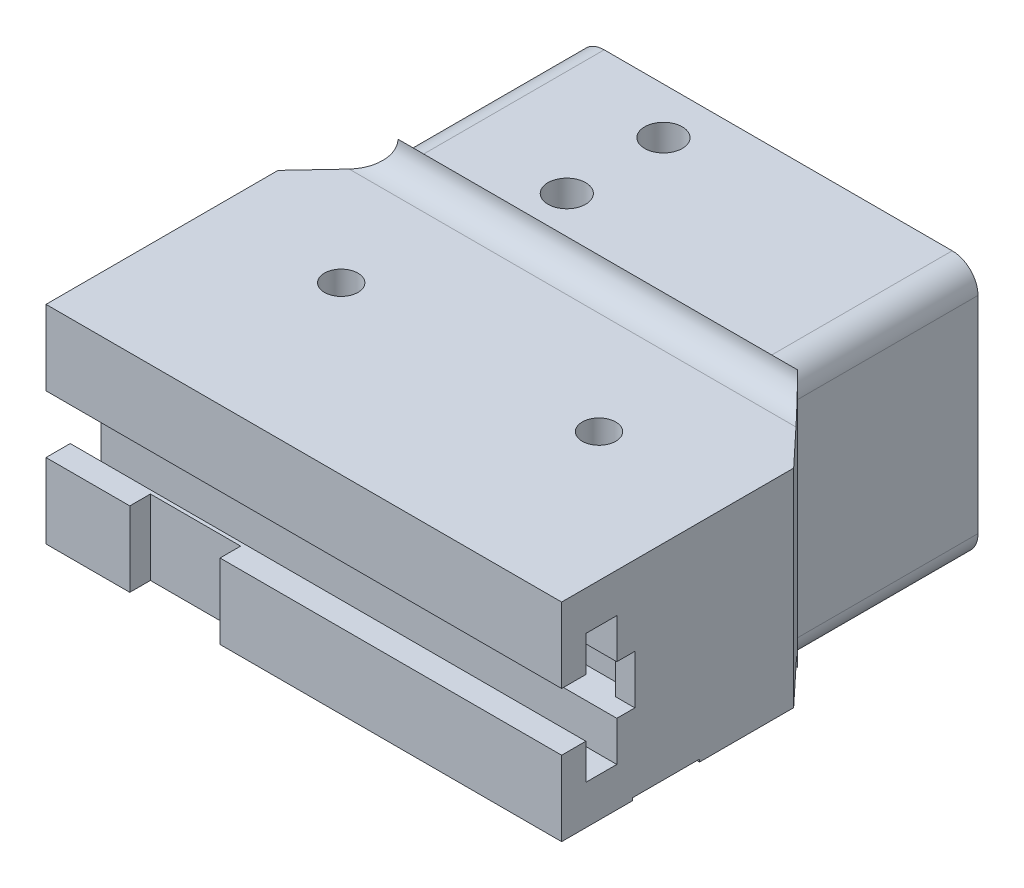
ISO-10303-21;
HEADER;
FILE_DESCRIPTION(('STEP AP214'),'2;1');
FILE_NAME('part.step','',(''),(''),'','','');
FILE_SCHEMA(('AUTOMOTIVE_DESIGN { 1 0 10303 214 1 1 1 1 }'));
ENDSEC;
DATA;
#1=APPLICATION_CONTEXT('core data for automotive mechanical design processes');
#2=APPLICATION_PROTOCOL_DEFINITION('international standard','automotive_design',2000,#1);
#3=PRODUCT_CONTEXT('',#1,'mechanical');
#4=PRODUCT('Part','Part','',(#3));
#5=PRODUCT_RELATED_PRODUCT_CATEGORY('part','',(#4));
#6=PRODUCT_DEFINITION_FORMATION('','',#4);
#7=PRODUCT_DEFINITION_CONTEXT('part definition',#1,'design');
#8=PRODUCT_DEFINITION('design','',#6,#7);
#9=PRODUCT_DEFINITION_SHAPE('','',#8);
#10=(LENGTH_UNIT() NAMED_UNIT(*) SI_UNIT(.MILLI.,.METRE.));
#11=(NAMED_UNIT(*) PLANE_ANGLE_UNIT() SI_UNIT($,.RADIAN.));
#12=(NAMED_UNIT(*) SI_UNIT($,.STERADIAN.) SOLID_ANGLE_UNIT());
#13=UNCERTAINTY_MEASURE_WITH_UNIT(LENGTH_MEASURE(1.E-05),#10,'distance_accuracy_value','');
#14=(GEOMETRIC_REPRESENTATION_CONTEXT(3) GLOBAL_UNCERTAINTY_ASSIGNED_CONTEXT((#13)) GLOBAL_UNIT_ASSIGNED_CONTEXT((#10,
#11,#12)) REPRESENTATION_CONTEXT('',''));
#15=CARTESIAN_POINT('',(0.,0.,0.));
#16=DIRECTION('',(0.,0.,1.));
#17=DIRECTION('',(1.,0.,0.));
#18=AXIS2_PLACEMENT_3D('',#15,#16,#17);
#19=CARTESIAN_POINT('',(-22.466,2.96549999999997,35.979));
#20=DIRECTION('',(0.,1.,0.));
#21=DIRECTION('',(0.,0.,1.));
#22=AXIS2_PLACEMENT_3D('',#19,#20,#21);
#23=PLANE('',#22);
#24=CARTESIAN_POINT('',(-22.339,2.96549999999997,35.979));
#25=DIRECTION('',(0.,-1.,0.));
#26=DIRECTION('',(0.,0.,-1.));
#27=AXIS2_PLACEMENT_3D('',#24,#25,#26);
#28=CIRCLE('',#27,1.397);
#29=CARTESIAN_POINT('',(-22.339,2.96549999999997,34.582));
#30=VERTEX_POINT('',#29);
#31=EDGE_CURVE('E21',#30,#30,#28,.T.);
#32=ORIENTED_EDGE('',*,*,#31,.T.);
#33=EDGE_LOOP('',(#32));
#34=FACE_BOUND('',#33,.T.);
#35=ADVANCED_FACE('F17',(#34),#23,.F.);
#36=CARTESIAN_POINT('',(-37.706,2.96549999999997,35.979));
#37=DIRECTION('',(0.,1.,0.));
#38=DIRECTION('',(0.,0.,1.));
#39=AXIS2_PLACEMENT_3D('',#36,#37,#38);
#40=PLANE('',#39);
#41=CARTESIAN_POINT('',(-37.833,2.96549999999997,35.979));
#42=DIRECTION('',(0.,-1.,0.));
#43=DIRECTION('',(0.,0.,-1.));
#44=AXIS2_PLACEMENT_3D('',#41,#42,#43);
#45=CIRCLE('',#44,1.397);
#46=CARTESIAN_POINT('',(-37.833,2.96549999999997,34.582));
#47=VERTEX_POINT('',#46);
#48=EDGE_CURVE('E321',#47,#47,#45,.T.);
#49=ORIENTED_EDGE('',*,*,#48,.T.);
#50=EDGE_LOOP('',(#49));
#51=FACE_BOUND('',#50,.T.);
#52=ADVANCED_FACE('F474',(#51),#40,.F.);
#53=CARTESIAN_POINT('',(-22.339,2.96549999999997,35.979));
#54=DIRECTION('',(0.,-1.,0.));
#55=DIRECTION('',(0.,0.,-1.));
#56=AXIS2_PLACEMENT_3D('',#53,#54,#55);
#57=CYLINDRICAL_SURFACE('',#56,1.397);
#58=ORIENTED_EDGE('',*,*,#31,.F.);
#59=EDGE_LOOP('',(#58));
#60=FACE_BOUND('',#59,.T.);
#61=CARTESIAN_POINT('',(-22.339,-0.209500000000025,35.979));
#62=DIRECTION('',(0.,-1.,0.));
#63=DIRECTION('',(0.,0.,-1.));
#64=AXIS2_PLACEMENT_3D('',#61,#62,#63);
#65=CIRCLE('',#64,1.397);
#66=CARTESIAN_POINT('',(-22.339,-0.209500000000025,34.582));
#67=VERTEX_POINT('',#66);
#68=EDGE_CURVE('E461',#67,#67,#65,.F.);
#69=ORIENTED_EDGE('',*,*,#68,.F.);
#70=EDGE_LOOP('',(#69));
#71=FACE_BOUND('',#70,.T.);
#72=ADVANCED_FACE('F470',(#60,#71),#57,.F.);
#73=CARTESIAN_POINT('',(-37.833,2.96549999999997,35.979));
#74=DIRECTION('',(0.,-1.,0.));
#75=DIRECTION('',(0.,0.,-1.));
#76=AXIS2_PLACEMENT_3D('',#73,#74,#75);
#77=CYLINDRICAL_SURFACE('',#76,1.397);
#78=ORIENTED_EDGE('',*,*,#48,.F.);
#79=EDGE_LOOP('',(#78));
#80=FACE_BOUND('',#79,.T.);
#81=CARTESIAN_POINT('',(-37.833,-0.209500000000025,35.979));
#82=DIRECTION('',(0.,-1.,0.));
#83=DIRECTION('',(0.,0.,-1.));
#84=AXIS2_PLACEMENT_3D('',#81,#82,#83);
#85=CIRCLE('',#84,1.397);
#86=CARTESIAN_POINT('',(-37.833,-0.209500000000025,34.582));
#87=VERTEX_POINT('',#86);
#88=EDGE_CURVE('E457',#87,#87,#85,.F.);
#89=ORIENTED_EDGE('',*,*,#88,.F.);
#90=EDGE_LOOP('',(#89));
#91=FACE_BOUND('',#90,.T.);
#92=ADVANCED_FACE('F473',(#80,#91),#77,.F.);
#93=CARTESIAN_POINT('',(-31.61,1.98759999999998,44.234));
#94=DIRECTION('',(0.,0.,1.));
#95=DIRECTION('',(1.,0.,0.));
#96=AXIS2_PLACEMENT_3D('',#93,#94,#95);
#97=PLANE('',#96);
#98=DIRECTION('',(1.,0.,0.));
#99=VECTOR('',#98,1.);
#100=CARTESIAN_POINT('',(32.017,6.91519999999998,44.234));
#101=LINE('',#100,#99);
#102=CARTESIAN_POINT('',(-27.165,6.91519999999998,44.234));
#103=VERTEX_POINT('',#102);
#104=CARTESIAN_POINT('',(-36.055,6.91519999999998,44.234));
#105=VERTEX_POINT('',#104);
#106=EDGE_CURVE('E316',#103,#105,#101,.F.);
#107=ORIENTED_EDGE('',*,*,#106,.T.);
#108=DIRECTION('',(0.,1.,0.));
#109=VECTOR('',#108,1.);
#110=CARTESIAN_POINT('',(-36.055,1.98759999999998,44.234));
#111=LINE('',#110,#109);
#112=CARTESIAN_POINT('',(-36.055,-0.463500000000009,44.234));
#113=VERTEX_POINT('',#112);
#114=EDGE_CURVE('E314',#113,#105,#111,.T.);
#115=ORIENTED_EDGE('',*,*,#114,.F.);
#116=DIRECTION('',(1.,0.,0.));
#117=VECTOR('',#116,1.);
#118=CARTESIAN_POINT('',(-18.91,-0.463500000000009,44.234));
#119=LINE('',#118,#117);
#120=CARTESIAN_POINT('',(-27.165,-0.463500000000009,44.234));
#121=VERTEX_POINT('',#120);
#122=EDGE_CURVE('E302',#121,#113,#119,.F.);
#123=ORIENTED_EDGE('',*,*,#122,.F.);
#124=DIRECTION('',(0.,1.,0.));
#125=VECTOR('',#124,1.);
#126=CARTESIAN_POINT('',(-27.165,1.98759999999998,44.234));
#127=LINE('',#126,#125);
#128=EDGE_CURVE('E320',#103,#121,#127,.F.);
#129=ORIENTED_EDGE('',*,*,#128,.F.);
#130=EDGE_LOOP('',(#107,#115,#123,#129));
#131=FACE_BOUND('',#130,.T.);
#132=ADVANCED_FACE('F315',(#131),#97,.T.);
#133=CARTESIAN_POINT('',(-36.055,1.98759999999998,45.25));
#134=DIRECTION('',(1.,0.,0.));
#135=DIRECTION('',(0.,0.,-1.));
#136=AXIS2_PLACEMENT_3D('',#133,#134,#135);
#137=PLANE('',#136);
#138=DIRECTION('',(0.,0.,-1.));
#139=VECTOR('',#138,1.);
#140=CARTESIAN_POINT('',(-36.055,6.91519999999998,43.8784));
#141=LINE('',#140,#139);
#142=CARTESIAN_POINT('',(-36.055,6.91519999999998,46.266));
#143=VERTEX_POINT('',#142);
#144=EDGE_CURVE('E531',#105,#143,#141,.F.);
#145=ORIENTED_EDGE('',*,*,#144,.T.);
#146=DIRECTION('',(0.,1.,0.));
#147=VECTOR('',#146,1.);
#148=CARTESIAN_POINT('',(-36.055,9.75999999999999,46.266));
#149=LINE('',#148,#147);
#150=CARTESIAN_POINT('',(-36.055,-0.463500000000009,46.266));
#151=VERTEX_POINT('',#150);
#152=EDGE_CURVE('E324',#151,#143,#149,.T.);
#153=ORIENTED_EDGE('',*,*,#152,.F.);
#154=DIRECTION('',(0.,0.,-1.));
#155=VECTOR('',#154,1.);
#156=CARTESIAN_POINT('',(-36.055,-0.463500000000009,34.836));
#157=LINE('',#156,#155);
#158=EDGE_CURVE('E306',#113,#151,#157,.F.);
#159=ORIENTED_EDGE('',*,*,#158,.F.);
#160=ORIENTED_EDGE('',*,*,#114,.T.);
#161=EDGE_LOOP('',(#145,#153,#159,#160));
#162=FACE_BOUND('',#161,.T.);
#163=ADVANCED_FACE('F323',(#162),#137,.T.);
#164=CARTESIAN_POINT('',(-27.165,1.98759999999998,45.25));
#165=DIRECTION('',(-1.,0.,0.));
#166=DIRECTION('',(0.,0.,1.));
#167=AXIS2_PLACEMENT_3D('',#164,#165,#166);
#168=PLANE('',#167);
#169=DIRECTION('',(0.,0.,-1.));
#170=VECTOR('',#169,1.);
#171=CARTESIAN_POINT('',(-27.165,6.91519999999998,43.8784));
#172=LINE('',#171,#170);
#173=CARTESIAN_POINT('',(-27.165,6.91519999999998,46.266));
#174=VERTEX_POINT('',#173);
#175=EDGE_CURVE('E703',#174,#103,#172,.T.);
#176=ORIENTED_EDGE('',*,*,#175,.T.);
#177=ORIENTED_EDGE('',*,*,#128,.T.);
#178=DIRECTION('',(0.,0.,-1.));
#179=VECTOR('',#178,1.);
#180=CARTESIAN_POINT('',(-27.165,-0.463500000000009,34.836));
#181=LINE('',#180,#179);
#182=CARTESIAN_POINT('',(-27.165,-0.463500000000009,46.266));
#183=VERTEX_POINT('',#182);
#184=EDGE_CURVE('E309',#183,#121,#181,.T.);
#185=ORIENTED_EDGE('',*,*,#184,.F.);
#186=DIRECTION('',(0.,1.,0.));
#187=VECTOR('',#186,1.);
#188=CARTESIAN_POINT('',(-27.165,9.75999999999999,46.266));
#189=LINE('',#188,#187);
#190=EDGE_CURVE('E698',#174,#183,#189,.F.);
#191=ORIENTED_EDGE('',*,*,#190,.F.);
#192=EDGE_LOOP('',(#176,#177,#185,#191));
#193=FACE_BOUND('',#192,.T.);
#194=ADVANCED_FACE('F905',(#193),#168,.T.);
#195=CARTESIAN_POINT('',(4.58500000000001,9.75999999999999,38.4174));
#196=DIRECTION('',(-1.,0.,0.));
#197=DIRECTION('',(0.,0.,1.));
#198=AXIS2_PLACEMENT_3D('',#195,#196,#197);
#199=PLANE('',#198);
#200=DIRECTION('',(0.,0.,1.));
#201=VECTOR('',#200,1.);
#202=CARTESIAN_POINT('',(4.58500000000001,12.173,40.8304));
#203=LINE('',#202,#201);
#204=CARTESIAN_POINT('',(4.58500000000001,12.173,39.0524));
#205=VERTEX_POINT('',#204);
#206=CARTESIAN_POINT('',(4.58500000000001,12.173,37.7824));
#207=VERTEX_POINT('',#206);
#208=EDGE_CURVE('E649',#205,#207,#203,.F.);
#209=ORIENTED_EDGE('',*,*,#208,.T.);
#210=DIRECTION('',(0.,1.,0.));
#211=VECTOR('',#210,1.);
#212=CARTESIAN_POINT('',(4.58500000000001,9.75999999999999,37.7824));
#213=LINE('',#212,#211);
#214=CARTESIAN_POINT('',(4.58500000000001,7.34699999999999,37.7824));
#215=VERTEX_POINT('',#214);
#216=EDGE_CURVE('E644',#215,#207,#213,.T.);
#217=ORIENTED_EDGE('',*,*,#216,.F.);
#218=DIRECTION('',(0.,0.,-1.));
#219=VECTOR('',#218,1.);
#220=CARTESIAN_POINT('',(4.58500000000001,7.34699999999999,39.0524));
#221=LINE('',#220,#219);
#222=CARTESIAN_POINT('',(4.58500000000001,7.34699999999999,39.0524));
#223=VERTEX_POINT('',#222);
#224=EDGE_CURVE('E665',#215,#223,#221,.F.);
#225=ORIENTED_EDGE('',*,*,#224,.T.);
#226=DIRECTION('',(0.,1.,0.));
#227=VECTOR('',#226,1.);
#228=CARTESIAN_POINT('',(4.58500000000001,12.173,39.0524));
#229=LINE('',#228,#227);
#230=EDGE_CURVE('E660',#223,#205,#229,.T.);
#231=ORIENTED_EDGE('',*,*,#230,.T.);
#232=EDGE_LOOP('',(#209,#217,#225,#231));
#233=FACE_BOUND('',#232,.T.);
#234=ADVANCED_FACE('F1410',(#233),#199,.T.);
#235=CARTESIAN_POINT('',(0.775000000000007,9.75999999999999,37.7824));
#236=DIRECTION('',(0.,0.,1.));
#237=DIRECTION('',(1.,0.,0.));
#238=AXIS2_PLACEMENT_3D('',#235,#236,#237);
#239=PLANE('',#238);
#240=DIRECTION('',(0.,1.,0.));
#241=VECTOR('',#240,1.);
#242=CARTESIAN_POINT('',(-3.03499999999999,9.75999999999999,37.7824));
#243=LINE('',#242,#241);
#244=CARTESIAN_POINT('',(-3.03499999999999,7.34699999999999,37.7824));
#245=VERTEX_POINT('',#244);
#246=CARTESIAN_POINT('',(-3.03499999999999,12.173,37.7824));
#247=VERTEX_POINT('',#246);
#248=EDGE_CURVE('E635',#245,#247,#243,.T.);
#249=ORIENTED_EDGE('',*,*,#248,.F.);
#250=DIRECTION('',(1.,0.,0.));
#251=VECTOR('',#250,1.);
#252=CARTESIAN_POINT('',(9.665,7.34699999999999,37.7824));
#253=LINE('',#252,#251);
#254=EDGE_CURVE('E667',#245,#215,#253,.T.);
#255=ORIENTED_EDGE('',*,*,#254,.T.);
#256=ORIENTED_EDGE('',*,*,#216,.T.);
#257=DIRECTION('',(1.,0.,0.));
#258=VECTOR('',#257,1.);
#259=CARTESIAN_POINT('',(9.665,12.173,37.7824));
#260=LINE('',#259,#258);
#261=EDGE_CURVE('E640',#207,#247,#260,.F.);
#262=ORIENTED_EDGE('',*,*,#261,.T.);
#263=EDGE_LOOP('',(#249,#255,#256,#262));
#264=FACE_BOUND('',#263,.T.);
#265=ADVANCED_FACE('F1418',(#264),#239,.T.);
#266=CARTESIAN_POINT('',(-3.03499999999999,9.75999999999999,38.4174));
#267=DIRECTION('',(1.,0.,0.));
#268=DIRECTION('',(0.,0.,-1.));
#269=AXIS2_PLACEMENT_3D('',#266,#267,#268);
#270=PLANE('',#269);
#271=DIRECTION('',(0.,0.,-1.));
#272=VECTOR('',#271,1.);
#273=CARTESIAN_POINT('',(-3.03499999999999,7.34699999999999,39.0524));
#274=LINE('',#273,#272);
#275=CARTESIAN_POINT('',(-3.03499999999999,7.34699999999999,39.0524));
#276=VERTEX_POINT('',#275);
#277=EDGE_CURVE('E672',#276,#245,#274,.T.);
#278=ORIENTED_EDGE('',*,*,#277,.T.);
#279=ORIENTED_EDGE('',*,*,#248,.T.);
#280=DIRECTION('',(0.,0.,1.));
#281=VECTOR('',#280,1.);
#282=CARTESIAN_POINT('',(-3.03499999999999,12.173,40.8304));
#283=LINE('',#282,#281);
#284=CARTESIAN_POINT('',(-3.03499999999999,12.173,39.0524));
#285=VERTEX_POINT('',#284);
#286=EDGE_CURVE('E631',#247,#285,#283,.T.);
#287=ORIENTED_EDGE('',*,*,#286,.T.);
#288=DIRECTION('',(0.,1.,0.));
#289=VECTOR('',#288,1.);
#290=CARTESIAN_POINT('',(-3.03499999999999,12.173,39.0524));
#291=LINE('',#290,#289);
#292=EDGE_CURVE('E626',#285,#276,#291,.F.);
#293=ORIENTED_EDGE('',*,*,#292,.T.);
#294=EDGE_LOOP('',(#278,#279,#287,#293));
#295=FACE_BOUND('',#294,.T.);
#296=ADVANCED_FACE('F1427',(#295),#270,.T.);
#297=CARTESIAN_POINT('',(9.665,12.173,39.0524));
#298=DIRECTION('',(0.,0.,-1.));
#299=DIRECTION('',(-1.,0.,0.));
#300=AXIS2_PLACEMENT_3D('',#297,#298,#299);
#301=PLANE('',#300);
#302=DIRECTION('',(1.,0.,0.));
#303=VECTOR('',#302,1.);
#304=CARTESIAN_POINT('',(9.665,7.34699999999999,39.0524));
#305=LINE('',#304,#303);
#306=CARTESIAN_POINT('',(-34.785,7.34699999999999,39.0524));
#307=VERTEX_POINT('',#306);
#308=EDGE_CURVE('E677',#307,#276,#305,.T.);
#309=ORIENTED_EDGE('',*,*,#308,.T.);
#310=ORIENTED_EDGE('',*,*,#292,.F.);
#311=DIRECTION('',(1.,0.,0.));
#312=VECTOR('',#311,1.);
#313=CARTESIAN_POINT('',(9.665,12.173,39.0524));
#314=LINE('',#313,#312);
#315=CARTESIAN_POINT('',(-34.785,12.173,39.0524));
#316=VERTEX_POINT('',#315);
#317=EDGE_CURVE('E622',#285,#316,#314,.F.);
#318=ORIENTED_EDGE('',*,*,#317,.T.);
#319=DIRECTION('',(0.,1.,0.));
#320=VECTOR('',#319,1.);
#321=CARTESIAN_POINT('',(-34.785,9.75999999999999,39.0524));
#322=LINE('',#321,#320);
#323=EDGE_CURVE('E617',#307,#316,#322,.T.);
#324=ORIENTED_EDGE('',*,*,#323,.F.);
#325=EDGE_LOOP('',(#309,#310,#318,#324));
#326=FACE_BOUND('',#325,.T.);
#327=ADVANCED_FACE('F1436',(#326),#301,.F.);
#328=CARTESIAN_POINT('',(-34.785,9.75999999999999,38.4174));
#329=DIRECTION('',(-1.,0.,0.));
#330=DIRECTION('',(0.,0.,1.));
#331=AXIS2_PLACEMENT_3D('',#328,#329,#330);
#332=PLANE('',#331);
#333=DIRECTION('',(0.,0.,1.));
#334=VECTOR('',#333,1.);
#335=CARTESIAN_POINT('',(-34.785,12.173,40.8304));
#336=LINE('',#335,#334);
#337=CARTESIAN_POINT('',(-34.785,12.173,37.7824));
#338=VERTEX_POINT('',#337);
#339=EDGE_CURVE('E613',#316,#338,#336,.F.);
#340=ORIENTED_EDGE('',*,*,#339,.T.);
#341=DIRECTION('',(0.,1.,0.));
#342=VECTOR('',#341,1.);
#343=CARTESIAN_POINT('',(-34.785,9.75999999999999,37.7824));
#344=LINE('',#343,#342);
#345=CARTESIAN_POINT('',(-34.785,7.34699999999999,37.7824));
#346=VERTEX_POINT('',#345);
#347=EDGE_CURVE('E608',#346,#338,#344,.T.);
#348=ORIENTED_EDGE('',*,*,#347,.F.);
#349=DIRECTION('',(0.,0.,-1.));
#350=VECTOR('',#349,1.);
#351=CARTESIAN_POINT('',(-34.785,7.34699999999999,39.0524));
#352=LINE('',#351,#350);
#353=EDGE_CURVE('E682',#346,#307,#352,.F.);
#354=ORIENTED_EDGE('',*,*,#353,.T.);
#355=ORIENTED_EDGE('',*,*,#323,.T.);
#356=EDGE_LOOP('',(#340,#348,#354,#355));
#357=FACE_BOUND('',#356,.T.);
#358=ADVANCED_FACE('F1445',(#357),#332,.T.);
#359=CARTESIAN_POINT('',(-38.595,9.75999999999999,37.7824));
#360=DIRECTION('',(0.,0.,1.));
#361=DIRECTION('',(1.,0.,0.));
#362=AXIS2_PLACEMENT_3D('',#359,#360,#361);
#363=PLANE('',#362);
#364=ORIENTED_EDGE('',*,*,#347,.T.);
#365=DIRECTION('',(1.,0.,0.));
#366=VECTOR('',#365,1.);
#367=CARTESIAN_POINT('',(9.665,12.173,37.7824));
#368=LINE('',#367,#366);
#369=CARTESIAN_POINT('',(-42.405,12.173,37.7824));
#370=VERTEX_POINT('',#369);
#371=EDGE_CURVE('E604',#338,#370,#368,.F.);
#372=ORIENTED_EDGE('',*,*,#371,.T.);
#373=DIRECTION('',(0.,1.,0.));
#374=VECTOR('',#373,1.);
#375=CARTESIAN_POINT('',(-42.405,9.75999999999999,37.7824));
#376=LINE('',#375,#374);
#377=CARTESIAN_POINT('',(-42.405,7.34699999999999,37.7824));
#378=VERTEX_POINT('',#377);
#379=EDGE_CURVE('E599',#378,#370,#376,.T.);
#380=ORIENTED_EDGE('',*,*,#379,.F.);
#381=DIRECTION('',(1.,0.,0.));
#382=VECTOR('',#381,1.);
#383=CARTESIAN_POINT('',(9.665,7.34699999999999,37.7824));
#384=LINE('',#383,#382);
#385=EDGE_CURVE('E687',#378,#346,#384,.T.);
#386=ORIENTED_EDGE('',*,*,#385,.T.);
#387=EDGE_LOOP('',(#364,#372,#380,#386));
#388=FACE_BOUND('',#387,.T.);
#389=ADVANCED_FACE('F1454',(#388),#363,.T.);
#390=CARTESIAN_POINT('',(-42.405,9.75999999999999,38.4174));
#391=DIRECTION('',(1.,0.,0.));
#392=DIRECTION('',(0.,0.,-1.));
#393=AXIS2_PLACEMENT_3D('',#390,#391,#392);
#394=PLANE('',#393);
#395=DIRECTION('',(0.,0.,-1.));
#396=VECTOR('',#395,1.);
#397=CARTESIAN_POINT('',(-42.405,7.34699999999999,39.0524));
#398=LINE('',#397,#396);
#399=CARTESIAN_POINT('',(-42.405,7.34699999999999,39.0524));
#400=VERTEX_POINT('',#399);
#401=EDGE_CURVE('E557',#400,#378,#398,.T.);
#402=ORIENTED_EDGE('',*,*,#401,.T.);
#403=ORIENTED_EDGE('',*,*,#379,.T.);
#404=DIRECTION('',(0.,0.,1.));
#405=VECTOR('',#404,1.);
#406=CARTESIAN_POINT('',(-42.405,12.173,40.8304));
#407=LINE('',#406,#405);
#408=CARTESIAN_POINT('',(-42.405,12.173,39.0524));
#409=VERTEX_POINT('',#408);
#410=EDGE_CURVE('E574',#370,#409,#407,.T.);
#411=ORIENTED_EDGE('',*,*,#410,.T.);
#412=DIRECTION('',(0.,1.,0.));
#413=VECTOR('',#412,1.);
#414=CARTESIAN_POINT('',(-42.405,12.173,39.0524));
#415=LINE('',#414,#413);
#416=EDGE_CURVE('E597',#409,#400,#415,.F.);
#417=ORIENTED_EDGE('',*,*,#416,.T.);
#418=EDGE_LOOP('',(#402,#403,#411,#417));
#419=FACE_BOUND('',#418,.T.);
#420=ADVANCED_FACE('F1463',(#419),#394,.T.);
#421=CARTESIAN_POINT('',(9.665,12.173,39.0524));
#422=DIRECTION('',(0.,0.,-1.));
#423=DIRECTION('',(-1.,0.,0.));
#424=AXIS2_PLACEMENT_3D('',#421,#422,#423);
#425=PLANE('',#424);
#426=DIRECTION('',(1.,0.,0.));
#427=VECTOR('',#426,1.);
#428=CARTESIAN_POINT('',(9.665,12.173,39.0524));
#429=LINE('',#428,#427);
#430=CARTESIAN_POINT('',(-44.31,12.173,39.0524));
#431=VERTEX_POINT('',#430);
#432=EDGE_CURVE('E571',#409,#431,#429,.F.);
#433=ORIENTED_EDGE('',*,*,#432,.T.);
#434=DIRECTION('',(0.,1.,0.));
#435=VECTOR('',#434,1.);
#436=CARTESIAN_POINT('',(-44.31,9.75999999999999,39.0524));
#437=LINE('',#436,#435);
#438=CARTESIAN_POINT('',(-44.31,7.34699999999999,39.0524));
#439=VERTEX_POINT('',#438);
#440=EDGE_CURVE('E551',#431,#439,#437,.F.);
#441=ORIENTED_EDGE('',*,*,#440,.T.);
#442=DIRECTION('',(1.,0.,0.));
#443=VECTOR('',#442,1.);
#444=CARTESIAN_POINT('',(9.665,7.34699999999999,39.0524));
#445=LINE('',#444,#443);
#446=EDGE_CURVE('E554',#439,#400,#445,.T.);
#447=ORIENTED_EDGE('',*,*,#446,.T.);
#448=ORIENTED_EDGE('',*,*,#416,.F.);
#449=EDGE_LOOP('',(#433,#441,#447,#448));
#450=FACE_BOUND('',#449,.T.);
#451=ADVANCED_FACE('F932',(#450),#425,.F.);
#452=CARTESIAN_POINT('',(-18.91,9.75999999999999,46.266));
#453=DIRECTION('',(0.,0.,1.));
#454=DIRECTION('',(1.,0.,0.));
#455=AXIS2_PLACEMENT_3D('',#452,#453,#454);
#456=PLANE('',#455);
#457=DIRECTION('',(1.,0.,0.));
#458=VECTOR('',#457,1.);
#459=CARTESIAN_POINT('',(32.017,6.91519999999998,46.266));
#460=LINE('',#459,#458);
#461=CARTESIAN_POINT('',(-44.31,6.91519999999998,46.266));
#462=VERTEX_POINT('',#461);
#463=EDGE_CURVE('E528',#143,#462,#460,.F.);
#464=ORIENTED_EDGE('',*,*,#463,.T.);
#465=DIRECTION('',(0.,1.,0.));
#466=VECTOR('',#465,1.);
#467=CARTESIAN_POINT('',(-44.31,9.75999999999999,46.266));
#468=LINE('',#467,#466);
#469=CARTESIAN_POINT('',(-44.31,-0.463500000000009,46.266));
#470=VERTEX_POINT('',#469);
#471=EDGE_CURVE('E507',#462,#470,#468,.F.);
#472=ORIENTED_EDGE('',*,*,#471,.T.);
#473=DIRECTION('',(1.,0.,0.));
#474=VECTOR('',#473,1.);
#475=CARTESIAN_POINT('',(-18.91,-0.463500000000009,46.266));
#476=LINE('',#475,#474);
#477=EDGE_CURVE('E326',#151,#470,#476,.F.);
#478=ORIENTED_EDGE('',*,*,#477,.F.);
#479=ORIENTED_EDGE('',*,*,#152,.T.);
#480=EDGE_LOOP('',(#464,#472,#478,#479));
#481=FACE_BOUND('',#480,.T.);
#482=ADVANCED_FACE('F482',(#481),#456,.T.);
#483=CARTESIAN_POINT('',(-18.91,-0.209500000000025,35.979));
#484=DIRECTION('',(0.,-1.,0.));
#485=DIRECTION('',(0.,0.,-1.));
#486=AXIS2_PLACEMENT_3D('',#483,#484,#485);
#487=PLANE('',#486);
#488=ORIENTED_EDGE('',*,*,#88,.T.);
#489=EDGE_LOOP('',(#488));
#490=FACE_BOUND('',#489,.T.);
#491=ORIENTED_EDGE('',*,*,#68,.T.);
#492=EDGE_LOOP('',(#491));
#493=FACE_BOUND('',#492,.T.);
#494=DIRECTION('',(-1.,0.,0.));
#495=VECTOR('',#494,1.);
#496=CARTESIAN_POINT('',(-18.91,-0.209500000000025,39.281));
#497=LINE('',#496,#495);
#498=CARTESIAN_POINT('',(-44.31,-0.209500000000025,39.281));
#499=VERTEX_POINT('',#498);
#500=CARTESIAN_POINT('',(6.49,-0.209500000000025,39.281));
#501=VERTEX_POINT('',#500);
#502=EDGE_CURVE('E460',#499,#501,#497,.F.);
#503=ORIENTED_EDGE('',*,*,#502,.F.);
#504=DIRECTION('',(0.,0.,-1.));
#505=VECTOR('',#504,1.);
#506=CARTESIAN_POINT('',(-44.31,-0.209500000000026,34.836));
#507=LINE('',#506,#505);
#508=CARTESIAN_POINT('',(-44.31,-0.209500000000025,32.677));
#509=VERTEX_POINT('',#508);
#510=EDGE_CURVE('E489',#499,#509,#507,.T.);
#511=ORIENTED_EDGE('',*,*,#510,.T.);
#512=DIRECTION('',(1.,0.,0.));
#513=VECTOR('',#512,1.);
#514=CARTESIAN_POINT('',(-18.91,-0.209500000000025,32.677));
#515=LINE('',#514,#513);
#516=CARTESIAN_POINT('',(6.49,-0.209500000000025,32.677));
#517=VERTEX_POINT('',#516);
#518=EDGE_CURVE('E741',#517,#509,#515,.F.);
#519=ORIENTED_EDGE('',*,*,#518,.F.);
#520=DIRECTION('',(0.,0.,1.));
#521=VECTOR('',#520,1.);
#522=CARTESIAN_POINT('',(6.49,-0.209500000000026,34.836));
#523=LINE('',#522,#521);
#524=EDGE_CURVE('E452',#517,#501,#523,.T.);
#525=ORIENTED_EDGE('',*,*,#524,.T.);
#526=EDGE_LOOP('',(#503,#511,#519,#525));
#527=FACE_BOUND('',#526,.T.);
#528=ADVANCED_FACE('F478',(#490,#493,#527),#487,.T.);
#529=CARTESIAN_POINT('',(-18.91,-0.336500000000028,39.281));
#530=DIRECTION('',(0.,0.,-1.));
#531=DIRECTION('',(-1.,0.,0.));
#532=AXIS2_PLACEMENT_3D('',#529,#530,#531);
#533=PLANE('',#532);
#534=DIRECTION('',(1.,0.,0.));
#535=VECTOR('',#534,1.);
#536=CARTESIAN_POINT('',(-18.91,-0.463500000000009,39.281));
#537=LINE('',#536,#535);
#538=CARTESIAN_POINT('',(-44.31,-0.463500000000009,39.281));
#539=VERTEX_POINT('',#538);
#540=CARTESIAN_POINT('',(6.49,-0.463500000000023,39.281));
#541=VERTEX_POINT('',#540);
#542=EDGE_CURVE('E494',#539,#541,#537,.T.);
#543=ORIENTED_EDGE('',*,*,#542,.F.);
#544=DIRECTION('',(0.,1.,0.));
#545=VECTOR('',#544,1.);
#546=CARTESIAN_POINT('',(-44.31,9.75999999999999,39.281));
#547=LINE('',#546,#545);
#548=EDGE_CURVE('E501',#539,#499,#547,.T.);
#549=ORIENTED_EDGE('',*,*,#548,.T.);
#550=ORIENTED_EDGE('',*,*,#502,.T.);
#551=DIRECTION('',(0.,1.,0.));
#552=VECTOR('',#551,1.);
#553=CARTESIAN_POINT('',(6.49,9.75999999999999,39.281));
#554=LINE('',#553,#552);
#555=EDGE_CURVE('E731',#501,#541,#554,.F.);
#556=ORIENTED_EDGE('',*,*,#555,.T.);
#557=EDGE_LOOP('',(#543,#549,#550,#556));
#558=FACE_BOUND('',#557,.T.);
#559=ADVANCED_FACE('F481',(#558),#533,.T.);
#560=CARTESIAN_POINT('',(-18.91,-0.463500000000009,34.836));
#561=DIRECTION('',(0.,-1.,0.));
#562=DIRECTION('',(0.,0.,-1.));
#563=AXIS2_PLACEMENT_3D('',#560,#561,#562);
#564=PLANE('',#563);
#565=ORIENTED_EDGE('',*,*,#477,.T.);
#566=DIRECTION('',(0.,0.,-1.));
#567=VECTOR('',#566,1.);
#568=CARTESIAN_POINT('',(-44.31,-0.463500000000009,34.836));
#569=LINE('',#568,#567);
#570=EDGE_CURVE('E505',#470,#539,#569,.T.);
#571=ORIENTED_EDGE('',*,*,#570,.T.);
#572=ORIENTED_EDGE('',*,*,#542,.T.);
#573=DIRECTION('',(0.,0.,1.));
#574=VECTOR('',#573,1.);
#575=CARTESIAN_POINT('',(6.49,-0.46350000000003,34.836));
#576=LINE('',#575,#574);
#577=CARTESIAN_POINT('',(6.49,-0.463500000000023,46.266));
#578=VERTEX_POINT('',#577);
#579=EDGE_CURVE('E733',#541,#578,#576,.T.);
#580=ORIENTED_EDGE('',*,*,#579,.T.);
#581=DIRECTION('',(1.,0.,0.));
#582=VECTOR('',#581,1.);
#583=CARTESIAN_POINT('',(-18.91,-0.463500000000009,46.266));
#584=LINE('',#583,#582);
#585=EDGE_CURVE('E328',#183,#578,#584,.T.);
#586=ORIENTED_EDGE('',*,*,#585,.F.);
#587=ORIENTED_EDGE('',*,*,#184,.T.);
#588=ORIENTED_EDGE('',*,*,#122,.T.);
#589=ORIENTED_EDGE('',*,*,#158,.T.);
#590=EDGE_LOOP('',(#565,#571,#572,#580,#586,#587,#588,#589));
#591=FACE_BOUND('',#590,.T.);
#592=ADVANCED_FACE('F304',(#591),#564,.T.);
#593=CARTESIAN_POINT('',(-18.91,9.75999999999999,46.266));
#594=DIRECTION('',(0.,0.,1.));
#595=DIRECTION('',(1.,0.,0.));
#596=AXIS2_PLACEMENT_3D('',#593,#594,#595);
#597=PLANE('',#596);
#598=DIRECTION('',(1.,0.,0.));
#599=VECTOR('',#598,1.);
#600=CARTESIAN_POINT('',(32.017,6.91519999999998,46.266));
#601=LINE('',#600,#599);
#602=CARTESIAN_POINT('',(6.49,6.91519999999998,46.266));
#603=VERTEX_POINT('',#602);
#604=EDGE_CURVE('E530',#603,#174,#601,.F.);
#605=ORIENTED_EDGE('',*,*,#604,.T.);
#606=ORIENTED_EDGE('',*,*,#190,.T.);
#607=ORIENTED_EDGE('',*,*,#585,.T.);
#608=DIRECTION('',(0.,1.,0.));
#609=VECTOR('',#608,1.);
#610=CARTESIAN_POINT('',(6.49,9.75999999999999,46.266));
#611=LINE('',#610,#609);
#612=EDGE_CURVE('E882',#578,#603,#611,.T.);
#613=ORIENTED_EDGE('',*,*,#612,.T.);
#614=EDGE_LOOP('',(#605,#606,#607,#613));
#615=FACE_BOUND('',#614,.T.);
#616=ADVANCED_FACE('F902',(#615),#597,.T.);
#617=CARTESIAN_POINT('',(32.017,6.91519999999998,43.8784));
#618=DIRECTION('',(0.,-1.,0.));
#619=DIRECTION('',(0.,0.,-1.));
#620=AXIS2_PLACEMENT_3D('',#617,#618,#619);
#621=PLANE('',#620);
#622=ORIENTED_EDGE('',*,*,#604,.F.);
#623=DIRECTION('',(0.,0.,1.));
#624=VECTOR('',#623,1.);
#625=CARTESIAN_POINT('',(6.49,6.91519999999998,34.836));
#626=LINE('',#625,#624);
#627=CARTESIAN_POINT('',(6.49,6.91519999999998,43.8784));
#628=VERTEX_POINT('',#627);
#629=EDGE_CURVE('E874',#603,#628,#626,.F.);
#630=ORIENTED_EDGE('',*,*,#629,.T.);
#631=DIRECTION('',(1.,0.,0.));
#632=VECTOR('',#631,1.);
#633=CARTESIAN_POINT('',(9.665,6.91519999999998,43.8784));
#634=LINE('',#633,#632);
#635=CARTESIAN_POINT('',(-44.31,6.91519999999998,43.8784));
#636=VERTEX_POINT('',#635);
#637=EDGE_CURVE('E706',#628,#636,#634,.F.);
#638=ORIENTED_EDGE('',*,*,#637,.T.);
#639=DIRECTION('',(0.,0.,-1.));
#640=VECTOR('',#639,1.);
#641=CARTESIAN_POINT('',(-44.31,6.91519999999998,34.836));
#642=LINE('',#641,#640);
#643=EDGE_CURVE('E520',#636,#462,#642,.F.);
#644=ORIENTED_EDGE('',*,*,#643,.T.);
#645=ORIENTED_EDGE('',*,*,#463,.F.);
#646=ORIENTED_EDGE('',*,*,#144,.F.);
#647=ORIENTED_EDGE('',*,*,#106,.F.);
#648=ORIENTED_EDGE('',*,*,#175,.F.);
#649=EDGE_LOOP('',(#622,#630,#638,#644,#645,#646,#647,#648));
#650=FACE_BOUND('',#649,.T.);
#651=ADVANCED_FACE('F907',(#650),#621,.F.);
#652=CARTESIAN_POINT('',(9.665,3.40999999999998,43.8784));
#653=DIRECTION('',(0.,0.,1.));
#654=DIRECTION('',(1.,0.,0.));
#655=AXIS2_PLACEMENT_3D('',#652,#653,#654);
#656=PLANE('',#655);
#657=DIRECTION('',(1.,0.,0.));
#658=VECTOR('',#657,1.);
#659=CARTESIAN_POINT('',(9.665,3.40999999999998,43.8784));
#660=LINE('',#659,#658);
#661=CARTESIAN_POINT('',(6.49,3.40999999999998,43.8784));
#662=VERTEX_POINT('',#661);
#663=CARTESIAN_POINT('',(-44.31,3.40999999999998,43.8784));
#664=VERTEX_POINT('',#663);
#665=EDGE_CURVE('E861',#662,#664,#660,.F.);
#666=ORIENTED_EDGE('',*,*,#665,.T.);
#667=DIRECTION('',(0.,1.,0.));
#668=VECTOR('',#667,1.);
#669=CARTESIAN_POINT('',(-44.31,9.75999999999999,43.8784));
#670=LINE('',#669,#668);
#671=EDGE_CURVE('E525',#664,#636,#670,.T.);
#672=ORIENTED_EDGE('',*,*,#671,.T.);
#673=ORIENTED_EDGE('',*,*,#637,.F.);
#674=DIRECTION('',(0.,1.,0.));
#675=VECTOR('',#674,1.);
#676=CARTESIAN_POINT('',(6.49,9.75999999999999,43.8784));
#677=LINE('',#676,#675);
#678=EDGE_CURVE('E866',#628,#662,#677,.F.);
#679=ORIENTED_EDGE('',*,*,#678,.T.);
#680=EDGE_LOOP('',(#666,#672,#673,#679));
#681=FACE_BOUND('',#680,.T.);
#682=ADVANCED_FACE('F915',(#681),#656,.F.);
#683=CARTESIAN_POINT('',(9.665,3.40999999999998,40.8304));
#684=DIRECTION('',(0.,-1.,0.));
#685=DIRECTION('',(0.,0.,-1.));
#686=AXIS2_PLACEMENT_3D('',#683,#684,#685);
#687=PLANE('',#686);
#688=DIRECTION('',(-1.,0.,0.));
#689=VECTOR('',#688,1.);
#690=CARTESIAN_POINT('',(9.665,3.40999999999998,40.8304));
#691=LINE('',#690,#689);
#692=CARTESIAN_POINT('',(6.49,3.40999999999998,40.8304));
#693=VERTEX_POINT('',#692);
#694=CARTESIAN_POINT('',(-44.31,3.40999999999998,40.8304));
#695=VERTEX_POINT('',#694);
#696=EDGE_CURVE('E852',#693,#695,#691,.T.);
#697=ORIENTED_EDGE('',*,*,#696,.T.);
#698=DIRECTION('',(0.,0.,-1.));
#699=VECTOR('',#698,1.);
#700=CARTESIAN_POINT('',(-44.31,3.40999999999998,34.836));
#701=LINE('',#700,#699);
#702=EDGE_CURVE('E536',#695,#664,#701,.F.);
#703=ORIENTED_EDGE('',*,*,#702,.T.);
#704=ORIENTED_EDGE('',*,*,#665,.F.);
#705=DIRECTION('',(0.,0.,1.));
#706=VECTOR('',#705,1.);
#707=CARTESIAN_POINT('',(6.49,3.40999999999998,34.836));
#708=LINE('',#707,#706);
#709=EDGE_CURVE('E857',#662,#693,#708,.F.);
#710=ORIENTED_EDGE('',*,*,#709,.T.);
#711=EDGE_LOOP('',(#697,#703,#704,#710));
#712=FACE_BOUND('',#711,.T.);
#713=ADVANCED_FACE('F918',(#712),#687,.F.);
#714=CARTESIAN_POINT('',(9.665,7.34699999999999,40.8304));
#715=DIRECTION('',(0.,0.,-1.));
#716=DIRECTION('',(-1.,0.,0.));
#717=AXIS2_PLACEMENT_3D('',#714,#715,#716);
#718=PLANE('',#717);
#719=DIRECTION('',(1.,0.,0.));
#720=VECTOR('',#719,1.);
#721=CARTESIAN_POINT('',(9.665,7.34699999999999,40.8304));
#722=LINE('',#721,#720);
#723=CARTESIAN_POINT('',(6.49,7.34699999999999,40.8304));
#724=VERTEX_POINT('',#723);
#725=CARTESIAN_POINT('',(-44.31,7.34699999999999,40.8304));
#726=VERTEX_POINT('',#725);
#727=EDGE_CURVE('E558',#724,#726,#722,.F.);
#728=ORIENTED_EDGE('',*,*,#727,.T.);
#729=DIRECTION('',(0.,1.,0.));
#730=VECTOR('',#729,1.);
#731=CARTESIAN_POINT('',(-44.31,9.75999999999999,40.8304));
#732=LINE('',#731,#730);
#733=EDGE_CURVE('E541',#726,#695,#732,.F.);
#734=ORIENTED_EDGE('',*,*,#733,.T.);
#735=ORIENTED_EDGE('',*,*,#696,.F.);
#736=DIRECTION('',(0.,1.,0.));
#737=VECTOR('',#736,1.);
#738=CARTESIAN_POINT('',(6.49,9.75999999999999,40.8304));
#739=LINE('',#738,#737);
#740=EDGE_CURVE('E848',#693,#724,#739,.T.);
#741=ORIENTED_EDGE('',*,*,#740,.T.);
#742=EDGE_LOOP('',(#728,#734,#735,#741));
#743=FACE_BOUND('',#742,.T.);
#744=ADVANCED_FACE('F923',(#743),#718,.F.);
#745=CARTESIAN_POINT('',(9.665,7.34699999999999,39.0524));
#746=DIRECTION('',(0.,-1.,0.));
#747=DIRECTION('',(0.,0.,-1.));
#748=AXIS2_PLACEMENT_3D('',#745,#746,#747);
#749=PLANE('',#748);
#750=DIRECTION('',(-1.,0.,0.));
#751=VECTOR('',#750,1.);
#752=CARTESIAN_POINT('',(9.665,7.34699999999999,39.0524));
#753=LINE('',#752,#751);
#754=CARTESIAN_POINT('',(6.49,7.34699999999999,39.0524));
#755=VERTEX_POINT('',#754);
#756=EDGE_CURVE('E662',#755,#223,#753,.T.);
#757=ORIENTED_EDGE('',*,*,#756,.T.);
#758=ORIENTED_EDGE('',*,*,#224,.F.);
#759=ORIENTED_EDGE('',*,*,#254,.F.);
#760=ORIENTED_EDGE('',*,*,#277,.F.);
#761=ORIENTED_EDGE('',*,*,#308,.F.);
#762=ORIENTED_EDGE('',*,*,#353,.F.);
#763=ORIENTED_EDGE('',*,*,#385,.F.);
#764=ORIENTED_EDGE('',*,*,#401,.F.);
#765=ORIENTED_EDGE('',*,*,#446,.F.);
#766=DIRECTION('',(0.,0.,-1.));
#767=VECTOR('',#766,1.);
#768=CARTESIAN_POINT('',(-44.31,7.34699999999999,34.836));
#769=LINE('',#768,#767);
#770=EDGE_CURVE('E546',#439,#726,#769,.F.);
#771=ORIENTED_EDGE('',*,*,#770,.T.);
#772=ORIENTED_EDGE('',*,*,#727,.F.);
#773=DIRECTION('',(0.,0.,1.));
#774=VECTOR('',#773,1.);
#775=CARTESIAN_POINT('',(6.49,7.34699999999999,34.836));
#776=LINE('',#775,#774);
#777=EDGE_CURVE('E839',#724,#755,#776,.F.);
#778=ORIENTED_EDGE('',*,*,#777,.T.);
#779=EDGE_LOOP('',(#757,#758,#759,#760,#761,#762,#763,#764,#765,#771,#772,#778));
#780=FACE_BOUND('',#779,.T.);
#781=ADVANCED_FACE('F928',(#780),#749,.F.);
#782=CARTESIAN_POINT('',(9.665,12.173,39.0524));
#783=DIRECTION('',(0.,0.,-1.));
#784=DIRECTION('',(-1.,0.,0.));
#785=AXIS2_PLACEMENT_3D('',#782,#783,#784);
#786=PLANE('',#785);
#787=ORIENTED_EDGE('',*,*,#756,.F.);
#788=DIRECTION('',(0.,1.,0.));
#789=VECTOR('',#788,1.);
#790=CARTESIAN_POINT('',(6.49,9.75999999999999,39.0524));
#791=LINE('',#790,#789);
#792=CARTESIAN_POINT('',(6.49,12.173,39.0524));
#793=VERTEX_POINT('',#792);
#794=EDGE_CURVE('E830',#755,#793,#791,.T.);
#795=ORIENTED_EDGE('',*,*,#794,.T.);
#796=DIRECTION('',(1.,0.,0.));
#797=VECTOR('',#796,1.);
#798=CARTESIAN_POINT('',(9.665,12.173,39.0524));
#799=LINE('',#798,#797);
#800=EDGE_CURVE('E657',#793,#205,#799,.F.);
#801=ORIENTED_EDGE('',*,*,#800,.T.);
#802=ORIENTED_EDGE('',*,*,#230,.F.);
#803=EDGE_LOOP('',(#787,#795,#801,#802));
#804=FACE_BOUND('',#803,.T.);
#805=ADVANCED_FACE('F1559',(#804),#786,.F.);
#806=CARTESIAN_POINT('',(9.665,12.173,40.8304));
#807=DIRECTION('',(0.,1.,0.));
#808=DIRECTION('',(0.,0.,1.));
#809=AXIS2_PLACEMENT_3D('',#806,#807,#808);
#810=PLANE('',#809);
#811=DIRECTION('',(-1.,0.,0.));
#812=VECTOR('',#811,1.);
#813=CARTESIAN_POINT('',(9.665,12.173,40.8304));
#814=LINE('',#813,#812);
#815=CARTESIAN_POINT('',(6.49,12.173,40.8304));
#816=VERTEX_POINT('',#815);
#817=CARTESIAN_POINT('',(-44.31,12.173,40.8304));
#818=VERTEX_POINT('',#817);
#819=EDGE_CURVE('E573',#816,#818,#814,.T.);
#820=ORIENTED_EDGE('',*,*,#819,.T.);
#821=DIRECTION('',(0.,0.,-1.));
#822=VECTOR('',#821,1.);
#823=CARTESIAN_POINT('',(-44.31,12.173,34.836));
#824=LINE('',#823,#822);
#825=EDGE_CURVE('E563',#818,#431,#824,.T.);
#826=ORIENTED_EDGE('',*,*,#825,.T.);
#827=ORIENTED_EDGE('',*,*,#432,.F.);
#828=ORIENTED_EDGE('',*,*,#410,.F.);
#829=ORIENTED_EDGE('',*,*,#371,.F.);
#830=ORIENTED_EDGE('',*,*,#339,.F.);
#831=ORIENTED_EDGE('',*,*,#317,.F.);
#832=ORIENTED_EDGE('',*,*,#286,.F.);
#833=ORIENTED_EDGE('',*,*,#261,.F.);
#834=ORIENTED_EDGE('',*,*,#208,.F.);
#835=ORIENTED_EDGE('',*,*,#800,.F.);
#836=DIRECTION('',(0.,0.,1.));
#837=VECTOR('',#836,1.);
#838=CARTESIAN_POINT('',(6.49,12.173,34.836));
#839=LINE('',#838,#837);
#840=EDGE_CURVE('E822',#793,#816,#839,.T.);
#841=ORIENTED_EDGE('',*,*,#840,.T.);
#842=EDGE_LOOP('',(#820,#826,#827,#828,#829,#830,#831,#832,#833,#834,#835,#841));
#843=FACE_BOUND('',#842,.T.);
#844=ADVANCED_FACE('F937',(#843),#810,.F.);
#845=CARTESIAN_POINT('',(9.665,16.11,40.8304));
#846=DIRECTION('',(0.,0.,-1.));
#847=DIRECTION('',(-1.,0.,0.));
#848=AXIS2_PLACEMENT_3D('',#845,#846,#847);
#849=PLANE('',#848);
#850=DIRECTION('',(1.,0.,0.));
#851=VECTOR('',#850,1.);
#852=CARTESIAN_POINT('',(9.665,16.11,40.8304));
#853=LINE('',#852,#851);
#854=CARTESIAN_POINT('',(6.49,16.11,40.8304));
#855=VERTEX_POINT('',#854);
#856=CARTESIAN_POINT('',(-44.31,16.11,40.8304));
#857=VERTEX_POINT('',#856);
#858=EDGE_CURVE('E809',#855,#857,#853,.F.);
#859=ORIENTED_EDGE('',*,*,#858,.T.);
#860=DIRECTION('',(0.,1.,0.));
#861=VECTOR('',#860,1.);
#862=CARTESIAN_POINT('',(-44.31,9.75999999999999,40.8304));
#863=LINE('',#862,#861);
#864=EDGE_CURVE('E568',#857,#818,#863,.F.);
#865=ORIENTED_EDGE('',*,*,#864,.T.);
#866=ORIENTED_EDGE('',*,*,#819,.F.);
#867=DIRECTION('',(0.,1.,0.));
#868=VECTOR('',#867,1.);
#869=CARTESIAN_POINT('',(6.49,9.75999999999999,40.8304));
#870=LINE('',#869,#868);
#871=EDGE_CURVE('E814',#816,#855,#870,.T.);
#872=ORIENTED_EDGE('',*,*,#871,.T.);
#873=EDGE_LOOP('',(#859,#865,#866,#872));
#874=FACE_BOUND('',#873,.T.);
#875=ADVANCED_FACE('F942',(#874),#849,.F.);
#876=CARTESIAN_POINT('',(9.665,16.11,43.8784));
#877=DIRECTION('',(0.,1.,0.));
#878=DIRECTION('',(0.,0.,1.));
#879=AXIS2_PLACEMENT_3D('',#876,#877,#878);
#880=PLANE('',#879);
#881=DIRECTION('',(1.,0.,0.));
#882=VECTOR('',#881,1.);
#883=CARTESIAN_POINT('',(9.665,16.11,43.8784));
#884=LINE('',#883,#882);
#885=CARTESIAN_POINT('',(6.49,16.11,43.8784));
#886=VERTEX_POINT('',#885);
#887=CARTESIAN_POINT('',(-44.31,16.11,43.8784));
#888=VERTEX_POINT('',#887);
#889=EDGE_CURVE('E800',#886,#888,#884,.F.);
#890=ORIENTED_EDGE('',*,*,#889,.T.);
#891=DIRECTION('',(0.,0.,-1.));
#892=VECTOR('',#891,1.);
#893=CARTESIAN_POINT('',(-44.31,16.11,34.836));
#894=LINE('',#893,#892);
#895=EDGE_CURVE('E579',#888,#857,#894,.T.);
#896=ORIENTED_EDGE('',*,*,#895,.T.);
#897=ORIENTED_EDGE('',*,*,#858,.F.);
#898=DIRECTION('',(0.,0.,1.));
#899=VECTOR('',#898,1.);
#900=CARTESIAN_POINT('',(6.49,16.11,34.836));
#901=LINE('',#900,#899);
#902=EDGE_CURVE('E805',#855,#886,#901,.T.);
#903=ORIENTED_EDGE('',*,*,#902,.T.);
#904=EDGE_LOOP('',(#890,#896,#897,#903));
#905=FACE_BOUND('',#904,.T.);
#906=ADVANCED_FACE('F947',(#905),#880,.F.);
#907=CARTESIAN_POINT('',(9.665,3.40999999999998,43.8784));
#908=DIRECTION('',(0.,0.,1.));
#909=DIRECTION('',(1.,0.,0.));
#910=AXIS2_PLACEMENT_3D('',#907,#908,#909);
#911=PLANE('',#910);
#912=DIRECTION('',(1.,0.,0.));
#913=VECTOR('',#912,1.);
#914=CARTESIAN_POINT('',(9.665,12.6048,43.8784));
#915=LINE('',#914,#913);
#916=CARTESIAN_POINT('',(6.49,12.6048,43.8784));
#917=VERTEX_POINT('',#916);
#918=CARTESIAN_POINT('',(-44.31,12.6048,43.8784));
#919=VERTEX_POINT('',#918);
#920=EDGE_CURVE('E744',#917,#919,#915,.F.);
#921=ORIENTED_EDGE('',*,*,#920,.T.);
#922=DIRECTION('',(0.,1.,0.));
#923=VECTOR('',#922,1.);
#924=CARTESIAN_POINT('',(-44.31,9.75999999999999,43.8784));
#925=LINE('',#924,#923);
#926=EDGE_CURVE('E584',#919,#888,#925,.T.);
#927=ORIENTED_EDGE('',*,*,#926,.T.);
#928=ORIENTED_EDGE('',*,*,#889,.F.);
#929=DIRECTION('',(0.,1.,0.));
#930=VECTOR('',#929,1.);
#931=CARTESIAN_POINT('',(6.49,9.75999999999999,43.8784));
#932=LINE('',#931,#930);
#933=EDGE_CURVE('E796',#886,#917,#932,.F.);
#934=ORIENTED_EDGE('',*,*,#933,.T.);
#935=EDGE_LOOP('',(#921,#927,#928,#934));
#936=FACE_BOUND('',#935,.T.);
#937=ADVANCED_FACE('F952',(#936),#911,.F.);
#938=CARTESIAN_POINT('',(9.665,12.6048,43.8784));
#939=DIRECTION('',(0.,1.,0.));
#940=DIRECTION('',(0.,0.,1.));
#941=AXIS2_PLACEMENT_3D('',#938,#939,#940);
#942=PLANE('',#941);
#943=DIRECTION('',(1.,0.,0.));
#944=VECTOR('',#943,1.);
#945=CARTESIAN_POINT('',(-18.91,12.6048,46.266));
#946=LINE('',#945,#944);
#947=CARTESIAN_POINT('',(-44.31,12.6048,46.266));
#948=VERTEX_POINT('',#947);
#949=CARTESIAN_POINT('',(6.49,12.6048,46.266));
#950=VERTEX_POINT('',#949);
#951=EDGE_CURVE('E743',#948,#950,#946,.T.);
#952=ORIENTED_EDGE('',*,*,#951,.F.);
#953=DIRECTION('',(0.,0.,-1.));
#954=VECTOR('',#953,1.);
#955=CARTESIAN_POINT('',(-44.31,12.6048,34.836));
#956=LINE('',#955,#954);
#957=EDGE_CURVE('E589',#948,#919,#956,.T.);
#958=ORIENTED_EDGE('',*,*,#957,.T.);
#959=ORIENTED_EDGE('',*,*,#920,.F.);
#960=DIRECTION('',(0.,0.,1.));
#961=VECTOR('',#960,1.);
#962=CARTESIAN_POINT('',(6.49,12.6048,34.836));
#963=LINE('',#962,#961);
#964=EDGE_CURVE('E781',#917,#950,#963,.T.);
#965=ORIENTED_EDGE('',*,*,#964,.T.);
#966=EDGE_LOOP('',(#952,#958,#959,#965));
#967=FACE_BOUND('',#966,.T.);
#968=ADVANCED_FACE('F954',(#967),#942,.F.);
#969=CARTESIAN_POINT('',(-18.91,-0.336500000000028,32.677));
#970=DIRECTION('',(0.,0.,1.));
#971=DIRECTION('',(1.,0.,0.));
#972=AXIS2_PLACEMENT_3D('',#969,#970,#971);
#973=PLANE('',#972);
#974=ORIENTED_EDGE('',*,*,#518,.T.);
#975=DIRECTION('',(0.,1.,0.));
#976=VECTOR('',#975,1.);
#977=CARTESIAN_POINT('',(-44.31,9.75999999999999,32.677));
#978=LINE('',#977,#976);
#979=CARTESIAN_POINT('',(-44.31,-0.463500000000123,32.677));
#980=VERTEX_POINT('',#979);
#981=EDGE_CURVE('E503',#509,#980,#978,.F.);
#982=ORIENTED_EDGE('',*,*,#981,.T.);
#983=DIRECTION('',(1.,0.,0.));
#984=VECTOR('',#983,1.);
#985=CARTESIAN_POINT('',(-44.31,-0.463500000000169,32.677));
#986=LINE('',#985,#984);
#987=CARTESIAN_POINT('',(6.49,-0.463500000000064,32.677));
#988=VERTEX_POINT('',#987);
#989=EDGE_CURVE('E456',#980,#988,#986,.T.);
#990=ORIENTED_EDGE('',*,*,#989,.T.);
#991=DIRECTION('',(0.,1.,0.));
#992=VECTOR('',#991,1.);
#993=CARTESIAN_POINT('',(6.49,9.75999999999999,32.677));
#994=LINE('',#993,#992);
#995=EDGE_CURVE('E786',#988,#517,#994,.T.);
#996=ORIENTED_EDGE('',*,*,#995,.T.);
#997=EDGE_LOOP('',(#974,#982,#990,#996));
#998=FACE_BOUND('',#997,.T.);
#999=ADVANCED_FACE('F1615',(#998),#973,.T.);
#1000=CARTESIAN_POINT('',(-18.91,9.75999999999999,46.266));
#1001=DIRECTION('',(0.,0.,1.));
#1002=DIRECTION('',(1.,0.,0.));
#1003=AXIS2_PLACEMENT_3D('',#1000,#1001,#1002);
#1004=PLANE('',#1003);
#1005=ORIENTED_EDGE('',*,*,#951,.T.);
#1006=DIRECTION('',(0.,1.,0.));
#1007=VECTOR('',#1006,1.);
#1008=CARTESIAN_POINT('',(6.49,9.75999999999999,46.266));
#1009=LINE('',#1008,#1007);
#1010=CARTESIAN_POINT('',(6.48999999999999,19.9835,46.266));
#1011=VERTEX_POINT('',#1010);
#1012=EDGE_CURVE('E777',#950,#1011,#1009,.T.);
#1013=ORIENTED_EDGE('',*,*,#1012,.T.);
#1014=DIRECTION('',(1.,0.,0.));
#1015=VECTOR('',#1014,1.);
#1016=CARTESIAN_POINT('',(6.48999999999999,19.9835,46.266));
#1017=LINE('',#1016,#1015);
#1018=CARTESIAN_POINT('',(-44.31,19.9835,46.266));
#1019=VERTEX_POINT('',#1018);
#1020=EDGE_CURVE('E765',#1011,#1019,#1017,.F.);
#1021=ORIENTED_EDGE('',*,*,#1020,.T.);
#1022=DIRECTION('',(0.,1.,0.));
#1023=VECTOR('',#1022,1.);
#1024=CARTESIAN_POINT('',(-44.31,9.75999999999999,46.266));
#1025=LINE('',#1024,#1023);
#1026=EDGE_CURVE('E594',#1019,#948,#1025,.F.);
#1027=ORIENTED_EDGE('',*,*,#1026,.T.);
#1028=EDGE_LOOP('',(#1005,#1013,#1021,#1027));
#1029=FACE_BOUND('',#1028,.T.);
#1030=ADVANCED_FACE('F961',(#1029),#1004,.T.);
#1031=CARTESIAN_POINT('',(-6.20999999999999,-0.463500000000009,29.883));
#1032=DIRECTION('',(0.,1.,0.));
#1033=DIRECTION('',(0.,0.,1.));
#1034=AXIS2_PLACEMENT_3D('',#1031,#1032,#1033);
#1035=CYLINDRICAL_SURFACE('',#1034,1.651);
#1036=CARTESIAN_POINT('',(-6.20999999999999,-0.463500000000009,29.883));
#1037=DIRECTION('',(0.,1.,0.));
#1038=DIRECTION('',(0.,0.,1.));
#1039=AXIS2_PLACEMENT_3D('',#1036,#1037,#1038);
#1040=CIRCLE('',#1039,1.651);
#1041=CARTESIAN_POINT('',(-6.20999999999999,-0.463500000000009,31.534));
#1042=VERTEX_POINT('',#1041);
#1043=EDGE_CURVE('E453',#1042,#1042,#1040,.F.);
#1044=ORIENTED_EDGE('',*,*,#1043,.T.);
#1045=EDGE_LOOP('',(#1044));
#1046=FACE_BOUND('',#1045,.T.);
#1047=CARTESIAN_POINT('',(-6.20999999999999,19.9835,29.883));
#1048=DIRECTION('',(0.,1.,0.));
#1049=DIRECTION('',(0.,0.,1.));
#1050=AXIS2_PLACEMENT_3D('',#1047,#1048,#1049);
#1051=CIRCLE('',#1050,1.651);
#1052=CARTESIAN_POINT('',(-6.20999999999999,19.9835,31.534));
#1053=VERTEX_POINT('',#1052);
#1054=EDGE_CURVE('E445',#1053,#1053,#1051,.T.);
#1055=ORIENTED_EDGE('',*,*,#1054,.T.);
#1056=EDGE_LOOP('',(#1055));
#1057=FACE_BOUND('',#1056,.T.);
#1058=ADVANCED_FACE('F1634',(#1046,#1057),#1035,.F.);
#1059=CARTESIAN_POINT('',(-31.61,-0.463500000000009,29.883));
#1060=DIRECTION('',(0.,1.,0.));
#1061=DIRECTION('',(0.,0.,1.));
#1062=AXIS2_PLACEMENT_3D('',#1059,#1060,#1061);
#1063=CYLINDRICAL_SURFACE('',#1062,1.651);
#1064=CARTESIAN_POINT('',(-31.61,-0.463500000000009,29.883));
#1065=DIRECTION('',(0.,1.,0.));
#1066=DIRECTION('',(0.,0.,1.));
#1067=AXIS2_PLACEMENT_3D('',#1064,#1065,#1066);
#1068=CIRCLE('',#1067,1.651);
#1069=CARTESIAN_POINT('',(-31.61,-0.463500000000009,31.534));
#1070=VERTEX_POINT('',#1069);
#1071=EDGE_CURVE('E449',#1070,#1070,#1068,.F.);
#1072=ORIENTED_EDGE('',*,*,#1071,.T.);
#1073=EDGE_LOOP('',(#1072));
#1074=FACE_BOUND('',#1073,.T.);
#1075=CARTESIAN_POINT('',(-31.61,19.9835,29.883));
#1076=DIRECTION('',(0.,1.,0.));
#1077=DIRECTION('',(0.,0.,1.));
#1078=AXIS2_PLACEMENT_3D('',#1075,#1076,#1077);
#1079=CIRCLE('',#1078,1.651);
#1080=CARTESIAN_POINT('',(-31.61,19.9835,31.534));
#1081=VERTEX_POINT('',#1080);
#1082=EDGE_CURVE('E441',#1081,#1081,#1079,.T.);
#1083=ORIENTED_EDGE('',*,*,#1082,.T.);
#1084=EDGE_LOOP('',(#1083));
#1085=FACE_BOUND('',#1084,.T.);
#1086=ADVANCED_FACE('F1644',(#1074,#1085),#1063,.F.);
#1087=CARTESIAN_POINT('',(-44.31,9.75999999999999,34.836));
#1088=DIRECTION('',(1.,0.,0.));
#1089=DIRECTION('',(0.,0.,-1.));
#1090=AXIS2_PLACEMENT_3D('',#1087,#1088,#1089);
#1091=PLANE('',#1090);
#1092=ORIENTED_EDGE('',*,*,#510,.F.);
#1093=ORIENTED_EDGE('',*,*,#548,.F.);
#1094=ORIENTED_EDGE('',*,*,#570,.F.);
#1095=ORIENTED_EDGE('',*,*,#471,.F.);
#1096=ORIENTED_EDGE('',*,*,#643,.F.);
#1097=ORIENTED_EDGE('',*,*,#671,.F.);
#1098=ORIENTED_EDGE('',*,*,#702,.F.);
#1099=ORIENTED_EDGE('',*,*,#733,.F.);
#1100=ORIENTED_EDGE('',*,*,#770,.F.);
#1101=ORIENTED_EDGE('',*,*,#440,.F.);
#1102=ORIENTED_EDGE('',*,*,#825,.F.);
#1103=ORIENTED_EDGE('',*,*,#864,.F.);
#1104=ORIENTED_EDGE('',*,*,#895,.F.);
#1105=ORIENTED_EDGE('',*,*,#926,.F.);
#1106=ORIENTED_EDGE('',*,*,#957,.F.);
#1107=ORIENTED_EDGE('',*,*,#1026,.F.);
#1108=DIRECTION('',(0.,0.,-1.));
#1109=VECTOR('',#1108,1.);
#1110=CARTESIAN_POINT('',(-44.31,19.9835,23.406));
#1111=LINE('',#1110,#1109);
#1112=CARTESIAN_POINT('',(-44.31,19.9834999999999,23.406));
#1113=VERTEX_POINT('',#1112);
#1114=EDGE_CURVE('E448',#1019,#1113,#1111,.T.);
#1115=ORIENTED_EDGE('',*,*,#1114,.T.);
#1116=DIRECTION('',(0.,1.,0.));
#1117=VECTOR('',#1116,1.);
#1118=CARTESIAN_POINT('',(-44.31,22.4599999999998,23.406));
#1119=LINE('',#1118,#1117);
#1120=CARTESIAN_POINT('',(-44.31,-0.463500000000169,23.406));
#1121=VERTEX_POINT('',#1120);
#1122=EDGE_CURVE('E759',#1113,#1121,#1119,.F.);
#1123=ORIENTED_EDGE('',*,*,#1122,.T.);
#1124=DIRECTION('',(0.,0.,1.));
#1125=VECTOR('',#1124,1.);
#1126=CARTESIAN_POINT('',(-44.31,-0.463500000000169,23.4059999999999));
#1127=LINE('',#1126,#1125);
#1128=EDGE_CURVE('E118',#1121,#980,#1127,.T.);
#1129=ORIENTED_EDGE('',*,*,#1128,.T.);
#1130=ORIENTED_EDGE('',*,*,#981,.F.);
#1131=EDGE_LOOP('',(#1092,#1093,#1094,#1095,#1096,#1097,#1098,#1099,#1100,#1101,#1102,#1103,
#1104,#1105,#1106,#1107,#1115,#1123,#1129,#1130));
#1132=FACE_BOUND('',#1131,.T.);
#1133=ADVANCED_FACE('F499',(#1132),#1091,.F.);
#1134=CARTESIAN_POINT('',(-44.31,-0.463500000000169,23.4059999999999));
#1135=DIRECTION('',(0.,1.,0.));
#1136=DIRECTION('',(0.,0.,1.));
#1137=AXIS2_PLACEMENT_3D('',#1134,#1135,#1136);
#1138=PLANE('',#1137);
#1139=ORIENTED_EDGE('',*,*,#1071,.F.);
#1140=EDGE_LOOP('',(#1139));
#1141=FACE_BOUND('',#1140,.T.);
#1142=ORIENTED_EDGE('',*,*,#1043,.F.);
#1143=EDGE_LOOP('',(#1142));
#1144=FACE_BOUND('',#1143,.T.);
#1145=DIRECTION('',(0.,0.,1.));
#1146=VECTOR('',#1145,1.);
#1147=CARTESIAN_POINT('',(6.49,-0.463500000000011,34.836));
#1148=LINE('',#1147,#1146);
#1149=CARTESIAN_POINT('',(6.49,-0.463500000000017,23.406));
#1150=VERTEX_POINT('',#1149);
#1151=EDGE_CURVE('E780',#1150,#988,#1148,.T.);
#1152=ORIENTED_EDGE('',*,*,#1151,.T.);
#1153=ORIENTED_EDGE('',*,*,#989,.F.);
#1154=ORIENTED_EDGE('',*,*,#1128,.F.);
#1155=DIRECTION('',(0.683941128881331,0.,-0.729537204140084));
#1156=VECTOR('',#1155,1.);
#1157=CARTESIAN_POINT('',(-44.31,-0.463500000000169,23.4059999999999));
#1158=LINE('',#1157,#1156);
#1159=CARTESIAN_POINT('',(-40.91671875,-0.463500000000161,19.7864999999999));
#1160=VERTEX_POINT('',#1159);
#1161=EDGE_CURVE('E761',#1121,#1160,#1158,.T.);
#1162=ORIENTED_EDGE('',*,*,#1161,.T.);
#1163=DIRECTION('',(1.,0.,0.));
#1164=VECTOR('',#1163,1.);
#1165=CARTESIAN_POINT('',(-44.31,-0.463500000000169,19.7864999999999));
#1166=LINE('',#1165,#1164);
#1167=CARTESIAN_POINT('',(3.09671874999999,-0.463500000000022,19.7865));
#1168=VERTEX_POINT('',#1167);
#1169=EDGE_CURVE('E439',#1160,#1168,#1166,.T.);
#1170=ORIENTED_EDGE('',*,*,#1169,.T.);
#1171=DIRECTION('',(0.683941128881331,0.,0.729537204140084));
#1172=VECTOR('',#1171,1.);
#1173=CARTESIAN_POINT('',(6.48999999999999,-0.463500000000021,23.406));
#1174=LINE('',#1173,#1172);
#1175=EDGE_CURVE('E435',#1168,#1150,#1174,.T.);
#1176=ORIENTED_EDGE('',*,*,#1175,.T.);
#1177=EDGE_LOOP('',(#1152,#1153,#1154,#1162,#1170,#1176));
#1178=FACE_BOUND('',#1177,.T.);
#1179=ADVANCED_FACE('F1039',(#1141,#1144,#1178),#1138,.F.);
#1180=CARTESIAN_POINT('',(6.49,9.75999999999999,34.836));
#1181=DIRECTION('',(-1.,0.,0.));
#1182=DIRECTION('',(0.,0.,1.));
#1183=AXIS2_PLACEMENT_3D('',#1180,#1181,#1182);
#1184=PLANE('',#1183);
#1185=ORIENTED_EDGE('',*,*,#1151,.F.);
#1186=DIRECTION('',(0.,1.,0.));
#1187=VECTOR('',#1186,1.);
#1188=CARTESIAN_POINT('',(6.49,-2.94000000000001,23.406));
#1189=LINE('',#1188,#1187);
#1190=CARTESIAN_POINT('',(6.49,19.9835,23.406));
#1191=VERTEX_POINT('',#1190);
#1192=EDGE_CURVE('E988',#1150,#1191,#1189,.T.);
#1193=ORIENTED_EDGE('',*,*,#1192,.T.);
#1194=DIRECTION('',(0.,0.,-1.));
#1195=VECTOR('',#1194,1.);
#1196=CARTESIAN_POINT('',(6.48999999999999,19.9835,23.406));
#1197=LINE('',#1196,#1195);
#1198=EDGE_CURVE('E774',#1191,#1011,#1197,.F.);
#1199=ORIENTED_EDGE('',*,*,#1198,.T.);
#1200=ORIENTED_EDGE('',*,*,#1012,.F.);
#1201=ORIENTED_EDGE('',*,*,#964,.F.);
#1202=ORIENTED_EDGE('',*,*,#933,.F.);
#1203=ORIENTED_EDGE('',*,*,#902,.F.);
#1204=ORIENTED_EDGE('',*,*,#871,.F.);
#1205=ORIENTED_EDGE('',*,*,#840,.F.);
#1206=ORIENTED_EDGE('',*,*,#794,.F.);
#1207=ORIENTED_EDGE('',*,*,#777,.F.);
#1208=ORIENTED_EDGE('',*,*,#740,.F.);
#1209=ORIENTED_EDGE('',*,*,#709,.F.);
#1210=ORIENTED_EDGE('',*,*,#678,.F.);
#1211=ORIENTED_EDGE('',*,*,#629,.F.);
#1212=ORIENTED_EDGE('',*,*,#612,.F.);
#1213=ORIENTED_EDGE('',*,*,#579,.F.);
#1214=ORIENTED_EDGE('',*,*,#555,.F.);
#1215=ORIENTED_EDGE('',*,*,#524,.F.);
#1216=ORIENTED_EDGE('',*,*,#995,.F.);
#1217=EDGE_LOOP('',(#1185,#1193,#1199,#1200,#1201,#1202,#1203,#1204,#1205,#1206,#1207,#1208,
#1209,#1210,#1211,#1212,#1213,#1214,#1215,#1216));
#1218=FACE_BOUND('',#1217,.T.);
#1219=ADVANCED_FACE('F898',(#1218),#1184,.F.);
#1220=CARTESIAN_POINT('',(6.48999999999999,19.9835,23.406));
#1221=DIRECTION('',(0.,-1.,0.));
#1222=DIRECTION('',(0.,0.,-1.));
#1223=AXIS2_PLACEMENT_3D('',#1220,#1221,#1222);
#1224=PLANE('',#1223);
#1225=ORIENTED_EDGE('',*,*,#1082,.F.);
#1226=EDGE_LOOP('',(#1225));
#1227=FACE_BOUND('',#1226,.T.);
#1228=ORIENTED_EDGE('',*,*,#1054,.F.);
#1229=EDGE_LOOP('',(#1228));
#1230=FACE_BOUND('',#1229,.T.);
#1231=DIRECTION('',(-1.,0.,0.));
#1232=VECTOR('',#1231,1.);
#1233=CARTESIAN_POINT('',(6.48999999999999,19.9835,19.7865));
#1234=LINE('',#1233,#1232);
#1235=CARTESIAN_POINT('',(3.09671875,19.9835,19.7865));
#1236=VERTEX_POINT('',#1235);
#1237=CARTESIAN_POINT('',(-40.9167187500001,19.9834999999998,19.7865));
#1238=VERTEX_POINT('',#1237);
#1239=EDGE_CURVE('E431',#1236,#1238,#1234,.T.);
#1240=ORIENTED_EDGE('',*,*,#1239,.T.);
#1241=DIRECTION('',(0.683941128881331,0.,-0.729537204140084));
#1242=VECTOR('',#1241,1.);
#1243=CARTESIAN_POINT('',(-44.31,19.9834999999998,23.4059999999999));
#1244=LINE('',#1243,#1242);
#1245=EDGE_CURVE('E444',#1238,#1113,#1244,.F.);
#1246=ORIENTED_EDGE('',*,*,#1245,.T.);
#1247=ORIENTED_EDGE('',*,*,#1114,.F.);
#1248=ORIENTED_EDGE('',*,*,#1020,.F.);
#1249=ORIENTED_EDGE('',*,*,#1198,.F.);
#1250=DIRECTION('',(0.683941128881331,0.,0.729537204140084));
#1251=VECTOR('',#1250,1.);
#1252=CARTESIAN_POINT('',(6.48999999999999,19.9835,23.406));
#1253=LINE('',#1252,#1251);
#1254=EDGE_CURVE('E985',#1191,#1236,#1253,.F.);
#1255=ORIENTED_EDGE('',*,*,#1254,.T.);
#1256=EDGE_LOOP('',(#1240,#1246,#1247,#1248,#1249,#1255));
#1257=FACE_BOUND('',#1256,.T.);
#1258=ADVANCED_FACE('F965',(#1227,#1230,#1257),#1224,.F.);
#1259=CARTESIAN_POINT('',(-25.4725518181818,17.888,4.102));
#1260=DIRECTION('',(0.,1.,0.));
#1261=DIRECTION('',(0.,0.,1.));
#1262=AXIS2_PLACEMENT_3D('',#1259,#1260,#1261);
#1263=PLANE('',#1262);
#1264=CARTESIAN_POINT('',(-25.641,17.888,4.102));
#1265=DIRECTION('',(0.,-1.,0.));
#1266=DIRECTION('',(0.,0.,-1.));
#1267=AXIS2_PLACEMENT_3D('',#1264,#1265,#1266);
#1268=CIRCLE('',#1267,1.85293);
#1269=CARTESIAN_POINT('',(-25.641,17.888,2.24907));
#1270=VERTEX_POINT('',#1269);
#1271=EDGE_CURVE('E420',#1270,#1270,#1268,.F.);
#1272=ORIENTED_EDGE('',*,*,#1271,.T.);
#1273=EDGE_LOOP('',(#1272));
#1274=FACE_BOUND('',#1273,.T.);
#1275=ADVANCED_FACE('F1693',(#1274),#1263,.T.);
#1276=CARTESIAN_POINT('',(-25.4725518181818,17.888,13.627));
#1277=DIRECTION('',(0.,1.,0.));
#1278=DIRECTION('',(0.,0.,1.));
#1279=AXIS2_PLACEMENT_3D('',#1276,#1277,#1278);
#1280=PLANE('',#1279);
#1281=CARTESIAN_POINT('',(-25.641,17.888,13.627));
#1282=DIRECTION('',(0.,-1.,0.));
#1283=DIRECTION('',(0.,0.,-1.));
#1284=AXIS2_PLACEMENT_3D('',#1281,#1282,#1283);
#1285=CIRCLE('',#1284,1.85293);
#1286=CARTESIAN_POINT('',(-25.641,17.888,11.77407));
#1287=VERTEX_POINT('',#1286);
#1288=EDGE_CURVE('E417',#1287,#1287,#1285,.F.);
#1289=ORIENTED_EDGE('',*,*,#1288,.T.);
#1290=EDGE_LOOP('',(#1289));
#1291=FACE_BOUND('',#1290,.T.);
#1292=ADVANCED_FACE('F1704',(#1291),#1280,.T.);
#1293=CARTESIAN_POINT('',(-18.91,-1.54300000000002,17.31));
#1294=DIRECTION('',(0.,0.,1.));
#1295=DIRECTION('',(1.,0.,0.));
#1296=AXIS2_PLACEMENT_3D('',#1293,#1294,#1295);
#1297=PLANE('',#1296);
#1298=DIRECTION('',(0.,1.,0.));
#1299=VECTOR('',#1298,1.);
#1300=CARTESIAN_POINT('',(-38.595,22.4599999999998,17.31));
#1301=LINE('',#1300,#1299);
#1302=CARTESIAN_POINT('',(-38.595,19.92,17.31));
#1303=VERTEX_POINT('',#1302);
#1304=CARTESIAN_POINT('',(-38.595,22.4599999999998,17.31));
#1305=VERTEX_POINT('',#1304);
#1306=EDGE_CURVE('E973',#1303,#1305,#1301,.T.);
#1307=ORIENTED_EDGE('',*,*,#1306,.T.);
#1308=DIRECTION('',(-1.,0.,0.));
#1309=VECTOR('',#1308,1.);
#1310=CARTESIAN_POINT('',(6.48999999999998,22.46,17.31));
#1311=LINE('',#1310,#1309);
#1312=CARTESIAN_POINT('',(-36.055,22.4599999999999,17.31));
#1313=VERTEX_POINT('',#1312);
#1314=EDGE_CURVE('E430',#1305,#1313,#1311,.F.);
#1315=ORIENTED_EDGE('',*,*,#1314,.T.);
#1316=CARTESIAN_POINT('',(-36.055,19.92,17.31));
#1317=DIRECTION('',(0.,0.,1.));
#1318=DIRECTION('',(1.,0.,0.));
#1319=AXIS2_PLACEMENT_3D('',#1316,#1317,#1318);
#1320=CIRCLE('',#1319,2.54);
#1321=EDGE_CURVE('E414',#1303,#1313,#1320,.F.);
#1322=ORIENTED_EDGE('',*,*,#1321,.F.);
#1323=EDGE_LOOP('',(#1307,#1315,#1322));
#1324=FACE_BOUND('',#1323,.T.);
#1325=ADVANCED_FACE('F1060',(#1324),#1297,.F.);
#1326=CARTESIAN_POINT('',(-44.31,22.4599999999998,23.4059999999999));
#1327=DIRECTION('',(0.729537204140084,0.,0.683941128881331));
#1328=DIRECTION('',(0.683941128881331,0.,-0.729537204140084));
#1329=AXIS2_PLACEMENT_3D('',#1326,#1327,#1328);
#1330=PLANE('',#1329);
#1331=ORIENTED_EDGE('',*,*,#1306,.F.);
#1332=DIRECTION('',(0.,1.,0.));
#1333=VECTOR('',#1332,1.);
#1334=CARTESIAN_POINT('',(-38.595,-0.399999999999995,17.31));
#1335=LINE('',#1334,#1333);
#1336=CARTESIAN_POINT('',(-38.595,-0.399999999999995,17.31));
#1337=VERTEX_POINT('',#1336);
#1338=EDGE_CURVE('E416',#1337,#1303,#1335,.T.);
#1339=ORIENTED_EDGE('',*,*,#1338,.F.);
#1340=DIRECTION('',(0.,1.,0.));
#1341=VECTOR('',#1340,1.);
#1342=CARTESIAN_POINT('',(-38.595,-1.54300000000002,17.31));
#1343=LINE('',#1342,#1341);
#1344=CARTESIAN_POINT('',(-38.595,-2.94000000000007,17.31));
#1345=VERTEX_POINT('',#1344);
#1346=EDGE_CURVE('E109',#1337,#1345,#1343,.F.);
#1347=ORIENTED_EDGE('',*,*,#1346,.T.);
#1348=CARTESIAN_POINT('',(-40.91671875,-2.94000000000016,19.7865));
#1349=DIRECTION('',(0.729537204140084,0.,0.683941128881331));
#1350=DIRECTION('',(0.683941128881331,0.,-0.729537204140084));
#1351=AXIS2_PLACEMENT_3D('',#1348,#1349,#1350);
#1352=ELLIPSE('',#1351,3.39461782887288,2.4765);
#1353=EDGE_CURVE('E437',#1345,#1160,#1352,.T.);
#1354=ORIENTED_EDGE('',*,*,#1353,.T.);
#1355=ORIENTED_EDGE('',*,*,#1161,.F.);
#1356=ORIENTED_EDGE('',*,*,#1122,.F.);
#1357=ORIENTED_EDGE('',*,*,#1245,.F.);
#1358=CARTESIAN_POINT('',(-40.9167187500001,22.4599999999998,19.7865));
#1359=DIRECTION('',(0.729537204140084,0.,0.683941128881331));
#1360=DIRECTION('',(-0.683941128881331,0.,0.729537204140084));
#1361=AXIS2_PLACEMENT_3D('',#1358,#1359,#1360);
#1362=ELLIPSE('',#1361,3.39461782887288,2.4765);
#1363=EDGE_CURVE('E427',#1238,#1305,#1362,.T.);
#1364=ORIENTED_EDGE('',*,*,#1363,.T.);
#1365=EDGE_LOOP('',(#1331,#1339,#1347,#1354,#1355,#1356,#1357,#1364));
#1366=FACE_BOUND('',#1365,.T.);
#1367=ADVANCED_FACE('F970',(#1366),#1330,.F.);
#1368=CARTESIAN_POINT('',(-18.91,-1.54300000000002,17.31));
#1369=DIRECTION('',(0.,0.,1.));
#1370=DIRECTION('',(1.,0.,0.));
#1371=AXIS2_PLACEMENT_3D('',#1368,#1369,#1370);
#1372=PLANE('',#1371);
#1373=DIRECTION('',(1.,0.,0.));
#1374=VECTOR('',#1373,1.);
#1375=CARTESIAN_POINT('',(-44.31,-2.94000000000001,17.3099999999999));
#1376=LINE('',#1375,#1374);
#1377=CARTESIAN_POINT('',(-36.055,-2.94,17.31));
#1378=VERTEX_POINT('',#1377);
#1379=EDGE_CURVE('E440',#1378,#1345,#1376,.F.);
#1380=ORIENTED_EDGE('',*,*,#1379,.T.);
#1381=ORIENTED_EDGE('',*,*,#1346,.F.);
#1382=CARTESIAN_POINT('',(-36.055,-0.399999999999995,17.31));
#1383=DIRECTION('',(0.,0.,1.));
#1384=DIRECTION('',(1.,0.,0.));
#1385=AXIS2_PLACEMENT_3D('',#1382,#1383,#1384);
#1386=CIRCLE('',#1385,2.54);
#1387=EDGE_CURVE('E409',#1378,#1337,#1386,.F.);
#1388=ORIENTED_EDGE('',*,*,#1387,.F.);
#1389=EDGE_LOOP('',(#1380,#1381,#1388));
#1390=FACE_BOUND('',#1389,.T.);
#1391=ADVANCED_FACE('F1075',(#1390),#1372,.F.);
#1392=CARTESIAN_POINT('',(-41.180799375,-2.94000000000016,19.7865));
#1393=DIRECTION('',(1.,0.,0.));
#1394=DIRECTION('',(0.,1.,0.));
#1395=AXIS2_PLACEMENT_3D('',#1392,#1393,#1394);
#1396=CYLINDRICAL_SURFACE('',#1395,2.4765);
#1397=ORIENTED_EDGE('',*,*,#1169,.F.);
#1398=ORIENTED_EDGE('',*,*,#1353,.F.);
#1399=ORIENTED_EDGE('',*,*,#1379,.F.);
#1400=DIRECTION('',(1.,0.,0.));
#1401=VECTOR('',#1400,1.);
#1402=CARTESIAN_POINT('',(-1.76500000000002,-2.94000000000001,17.31));
#1403=LINE('',#1402,#1401);
#1404=CARTESIAN_POINT('',(-1.76500000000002,-2.94,17.31));
#1405=VERTEX_POINT('',#1404);
#1406=EDGE_CURVE('E1014',#1405,#1378,#1403,.F.);
#1407=ORIENTED_EDGE('',*,*,#1406,.F.);
#1408=DIRECTION('',(1.,0.,0.));
#1409=VECTOR('',#1408,1.);
#1410=CARTESIAN_POINT('',(-18.91,-2.94000000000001,17.31));
#1411=LINE('',#1410,#1409);
#1412=CARTESIAN_POINT('',(0.774999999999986,-2.94000000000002,17.31));
#1413=VERTEX_POINT('',#1412);
#1414=EDGE_CURVE('E983',#1405,#1413,#1411,.T.);
#1415=ORIENTED_EDGE('',*,*,#1414,.T.);
#1416=CARTESIAN_POINT('',(3.09671874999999,-2.94000000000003,19.7865));
#1417=DIRECTION('',(-0.729537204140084,0.,0.683941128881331));
#1418=DIRECTION('',(0.683941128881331,0.,0.729537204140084));
#1419=AXIS2_PLACEMENT_3D('',#1416,#1417,#1418);
#1420=ELLIPSE('',#1419,3.39461782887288,2.4765);
#1421=EDGE_CURVE('E432',#1413,#1168,#1420,.F.);
#1422=ORIENTED_EDGE('',*,*,#1421,.T.);
#1423=EDGE_LOOP('',(#1397,#1398,#1399,#1407,#1415,#1422));
#1424=FACE_BOUND('',#1423,.T.);
#1425=ADVANCED_FACE('F1078',(#1424),#1396,.F.);
#1426=CARTESIAN_POINT('',(-18.91,-1.54300000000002,17.31));
#1427=DIRECTION('',(0.,0.,1.));
#1428=DIRECTION('',(1.,0.,0.));
#1429=AXIS2_PLACEMENT_3D('',#1426,#1427,#1428);
#1430=PLANE('',#1429);
#1431=DIRECTION('',(0.,1.,0.));
#1432=VECTOR('',#1431,1.);
#1433=CARTESIAN_POINT('',(0.774999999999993,-2.94000000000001,17.31));
#1434=LINE('',#1433,#1432);
#1435=CARTESIAN_POINT('',(0.774999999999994,-0.399999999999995,17.31));
#1436=VERTEX_POINT('',#1435);
#1437=EDGE_CURVE('E436',#1436,#1413,#1434,.F.);
#1438=ORIENTED_EDGE('',*,*,#1437,.T.);
#1439=ORIENTED_EDGE('',*,*,#1414,.F.);
#1440=CARTESIAN_POINT('',(-1.76500000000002,-0.399999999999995,17.31));
#1441=DIRECTION('',(0.,0.,1.));
#1442=DIRECTION('',(1.,0.,0.));
#1443=AXIS2_PLACEMENT_3D('',#1440,#1441,#1442);
#1444=CIRCLE('',#1443,2.54);
#1445=EDGE_CURVE('E404',#1436,#1405,#1444,.F.);
#1446=ORIENTED_EDGE('',*,*,#1445,.F.);
#1447=EDGE_LOOP('',(#1438,#1439,#1446));
#1448=FACE_BOUND('',#1447,.T.);
#1449=ADVANCED_FACE('F1092',(#1448),#1430,.F.);
#1450=CARTESIAN_POINT('',(6.48999999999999,-2.94000000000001,23.406));
#1451=DIRECTION('',(-0.729537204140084,0.,0.683941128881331));
#1452=DIRECTION('',(0.683941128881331,0.,0.729537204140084));
#1453=AXIS2_PLACEMENT_3D('',#1450,#1451,#1452);
#1454=PLANE('',#1453);
#1455=ORIENTED_EDGE('',*,*,#1254,.F.);
#1456=ORIENTED_EDGE('',*,*,#1192,.F.);
#1457=ORIENTED_EDGE('',*,*,#1175,.F.);
#1458=ORIENTED_EDGE('',*,*,#1421,.F.);
#1459=ORIENTED_EDGE('',*,*,#1437,.F.);
#1460=DIRECTION('',(0.,1.,0.));
#1461=VECTOR('',#1460,1.);
#1462=CARTESIAN_POINT('',(0.774999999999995,19.92,17.31));
#1463=LINE('',#1462,#1461);
#1464=CARTESIAN_POINT('',(0.774999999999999,19.92,17.31));
#1465=VERTEX_POINT('',#1464);
#1466=EDGE_CURVE('E1011',#1465,#1436,#1463,.F.);
#1467=ORIENTED_EDGE('',*,*,#1466,.F.);
#1468=DIRECTION('',(0.,1.,0.));
#1469=VECTOR('',#1468,1.);
#1470=CARTESIAN_POINT('',(0.774999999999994,-1.54300000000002,17.31));
#1471=LINE('',#1470,#1469);
#1472=CARTESIAN_POINT('',(0.774999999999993,22.46,17.31));
#1473=VERTEX_POINT('',#1472);
#1474=EDGE_CURVE('E987',#1465,#1473,#1471,.T.);
#1475=ORIENTED_EDGE('',*,*,#1474,.T.);
#1476=CARTESIAN_POINT('',(3.09671875,22.46,19.7865));
#1477=DIRECTION('',(-0.729537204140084,0.,0.683941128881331));
#1478=DIRECTION('',(-0.683941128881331,0.,-0.729537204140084));
#1479=AXIS2_PLACEMENT_3D('',#1476,#1477,#1478);
#1480=ELLIPSE('',#1479,3.39461782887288,2.4765);
#1481=EDGE_CURVE('E423',#1473,#1236,#1480,.T.);
#1482=ORIENTED_EDGE('',*,*,#1481,.T.);
#1483=EDGE_LOOP('',(#1455,#1456,#1457,#1458,#1459,#1467,#1475,#1482));
#1484=FACE_BOUND('',#1483,.T.);
#1485=ADVANCED_FACE('F1045',(#1484),#1454,.F.);
#1486=CARTESIAN_POINT('',(-18.91,-1.54300000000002,17.31));
#1487=DIRECTION('',(0.,0.,1.));
#1488=DIRECTION('',(1.,0.,0.));
#1489=AXIS2_PLACEMENT_3D('',#1486,#1487,#1488);
#1490=PLANE('',#1489);
#1491=DIRECTION('',(-1.,0.,0.));
#1492=VECTOR('',#1491,1.);
#1493=CARTESIAN_POINT('',(6.48999999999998,22.46,17.31));
#1494=LINE('',#1493,#1492);
#1495=CARTESIAN_POINT('',(-1.765,22.46,17.31));
#1496=VERTEX_POINT('',#1495);
#1497=EDGE_CURVE('E426',#1496,#1473,#1494,.F.);
#1498=ORIENTED_EDGE('',*,*,#1497,.T.);
#1499=ORIENTED_EDGE('',*,*,#1474,.F.);
#1500=CARTESIAN_POINT('',(-1.765,19.92,17.31));
#1501=DIRECTION('',(0.,0.,1.));
#1502=DIRECTION('',(1.,0.,0.));
#1503=AXIS2_PLACEMENT_3D('',#1500,#1501,#1502);
#1504=CIRCLE('',#1503,2.54);
#1505=EDGE_CURVE('E399',#1496,#1465,#1504,.F.);
#1506=ORIENTED_EDGE('',*,*,#1505,.F.);
#1507=EDGE_LOOP('',(#1498,#1499,#1506));
#1508=FACE_BOUND('',#1507,.T.);
#1509=ADVANCED_FACE('F1100',(#1508),#1490,.F.);
#1510=CARTESIAN_POINT('',(3.36079937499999,22.46,19.7865));
#1511=DIRECTION('',(-1.,0.,0.));
#1512=DIRECTION('',(0.,-1.,0.));
#1513=AXIS2_PLACEMENT_3D('',#1510,#1511,#1512);
#1514=CYLINDRICAL_SURFACE('',#1513,2.4765);
#1515=ORIENTED_EDGE('',*,*,#1497,.F.);
#1516=DIRECTION('',(1.,0.,0.));
#1517=VECTOR('',#1516,1.);
#1518=CARTESIAN_POINT('',(-36.055,22.46,17.31));
#1519=LINE('',#1518,#1517);
#1520=EDGE_CURVE('E1006',#1313,#1496,#1519,.T.);
#1521=ORIENTED_EDGE('',*,*,#1520,.F.);
#1522=ORIENTED_EDGE('',*,*,#1314,.F.);
#1523=ORIENTED_EDGE('',*,*,#1363,.F.);
#1524=ORIENTED_EDGE('',*,*,#1239,.F.);
#1525=ORIENTED_EDGE('',*,*,#1481,.F.);
#1526=EDGE_LOOP('',(#1515,#1521,#1522,#1523,#1524,#1525));
#1527=FACE_BOUND('',#1526,.T.);
#1528=ADVANCED_FACE('F1050',(#1527),#1514,.F.);
#1529=CARTESIAN_POINT('',(-25.641,22.46,4.102));
#1530=DIRECTION('',(0.,-1.,0.));
#1531=DIRECTION('',(0.,0.,-1.));
#1532=AXIS2_PLACEMENT_3D('',#1529,#1530,#1531);
#1533=CYLINDRICAL_SURFACE('',#1532,1.85293);
#1534=CARTESIAN_POINT('',(-25.641,22.46,4.102));
#1535=DIRECTION('',(0.,-1.,0.));
#1536=DIRECTION('',(0.,0.,-1.));
#1537=AXIS2_PLACEMENT_3D('',#1534,#1535,#1536);
#1538=CIRCLE('',#1537,1.85293);
#1539=CARTESIAN_POINT('',(-25.641,22.46,2.24907));
#1540=VERTEX_POINT('',#1539);
#1541=EDGE_CURVE('E395',#1540,#1540,#1538,.T.);
#1542=ORIENTED_EDGE('',*,*,#1541,.F.);
#1543=EDGE_LOOP('',(#1542));
#1544=FACE_BOUND('',#1543,.T.);
#1545=ORIENTED_EDGE('',*,*,#1271,.F.);
#1546=EDGE_LOOP('',(#1545));
#1547=FACE_BOUND('',#1546,.T.);
#1548=ADVANCED_FACE('F1190',(#1544,#1547),#1533,.F.);
#1549=CARTESIAN_POINT('',(-25.641,22.46,13.627));
#1550=DIRECTION('',(0.,-1.,0.));
#1551=DIRECTION('',(0.,0.,-1.));
#1552=AXIS2_PLACEMENT_3D('',#1549,#1550,#1551);
#1553=CYLINDRICAL_SURFACE('',#1552,1.85293);
#1554=CARTESIAN_POINT('',(-25.641,22.46,13.627));
#1555=DIRECTION('',(0.,-1.,0.));
#1556=DIRECTION('',(0.,0.,-1.));
#1557=AXIS2_PLACEMENT_3D('',#1554,#1555,#1556);
#1558=CIRCLE('',#1557,1.85293);
#1559=CARTESIAN_POINT('',(-25.641,22.46,11.77407));
#1560=VERTEX_POINT('',#1559);
#1561=EDGE_CURVE('E392',#1560,#1560,#1558,.T.);
#1562=ORIENTED_EDGE('',*,*,#1561,.F.);
#1563=EDGE_LOOP('',(#1562));
#1564=FACE_BOUND('',#1563,.T.);
#1565=ORIENTED_EDGE('',*,*,#1288,.F.);
#1566=EDGE_LOOP('',(#1565));
#1567=FACE_BOUND('',#1566,.T.);
#1568=ADVANCED_FACE('F1186',(#1564,#1567),#1553,.F.);
#1569=CARTESIAN_POINT('',(-34.6620409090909,9.75999999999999,9.182));
#1570=DIRECTION('',(0.,0.,1.));
#1571=DIRECTION('',(1.,0.,0.));
#1572=AXIS2_PLACEMENT_3D('',#1569,#1570,#1571);
#1573=PLANE('',#1572);
#1574=CARTESIAN_POINT('',(-34.785,9.75999999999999,9.182));
#1575=DIRECTION('',(0.,0.,1.));
#1576=DIRECTION('',(1.,0.,0.));
#1577=AXIS2_PLACEMENT_3D('',#1574,#1575,#1576);
#1578=CIRCLE('',#1577,1.35255);
#1579=CARTESIAN_POINT('',(-33.43245,9.75999999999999,9.182));
#1580=VERTEX_POINT('',#1579);
#1581=EDGE_CURVE('E389',#1580,#1580,#1578,.F.);
#1582=ORIENTED_EDGE('',*,*,#1581,.T.);
#1583=EDGE_LOOP('',(#1582));
#1584=FACE_BOUND('',#1583,.T.);
#1585=ADVANCED_FACE('F1182',(#1584),#1573,.F.);
#1586=CARTESIAN_POINT('',(-32.9077090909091,2.64799999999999,7.404));
#1587=DIRECTION('',(0.,0.,1.));
#1588=DIRECTION('',(1.,0.,0.));
#1589=AXIS2_PLACEMENT_3D('',#1586,#1587,#1588);
#1590=PLANE('',#1589);
#1591=CARTESIAN_POINT('',(-33.1975,2.64799999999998,7.404));
#1592=DIRECTION('',(0.,0.,-1.));
#1593=DIRECTION('',(-1.,0.,0.));
#1594=AXIS2_PLACEMENT_3D('',#1591,#1592,#1593);
#1595=CIRCLE('',#1594,3.1877);
#1596=CARTESIAN_POINT('',(-36.3852,2.64799999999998,7.404));
#1597=VERTEX_POINT('',#1596);
#1598=EDGE_CURVE('E386',#1597,#1597,#1595,.T.);
#1599=ORIENTED_EDGE('',*,*,#1598,.T.);
#1600=EDGE_LOOP('',(#1599));
#1601=FACE_BOUND('',#1600,.T.);
#1602=ADVANCED_FACE('F1178',(#1601),#1590,.F.);
#1603=CARTESIAN_POINT('',(-2.91204090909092,9.75999999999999,9.182));
#1604=DIRECTION('',(0.,0.,1.));
#1605=DIRECTION('',(1.,0.,0.));
#1606=AXIS2_PLACEMENT_3D('',#1603,#1604,#1605);
#1607=PLANE('',#1606);
#1608=CARTESIAN_POINT('',(-3.03500000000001,9.75999999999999,9.182));
#1609=DIRECTION('',(0.,0.,1.));
#1610=DIRECTION('',(1.,0.,0.));
#1611=AXIS2_PLACEMENT_3D('',#1608,#1609,#1610);
#1612=CIRCLE('',#1611,1.35255);
#1613=CARTESIAN_POINT('',(-1.68245000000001,9.75999999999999,9.182));
#1614=VERTEX_POINT('',#1613);
#1615=EDGE_CURVE('E383',#1614,#1614,#1612,.F.);
#1616=ORIENTED_EDGE('',*,*,#1615,.T.);
#1617=EDGE_LOOP('',(#1616));
#1618=FACE_BOUND('',#1617,.T.);
#1619=ADVANCED_FACE('F1174',(#1618),#1607,.F.);
#1620=CARTESIAN_POINT('',(-4.33270909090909,16.872,7.404));
#1621=DIRECTION('',(0.,0.,1.));
#1622=DIRECTION('',(1.,0.,0.));
#1623=AXIS2_PLACEMENT_3D('',#1620,#1621,#1622);
#1624=PLANE('',#1623);
#1625=CARTESIAN_POINT('',(-4.62250000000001,16.872,7.404));
#1626=DIRECTION('',(0.,0.,-1.));
#1627=DIRECTION('',(-1.,0.,0.));
#1628=AXIS2_PLACEMENT_3D('',#1625,#1626,#1627);
#1629=CIRCLE('',#1628,3.1877);
#1630=CARTESIAN_POINT('',(-7.81020000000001,16.872,7.404));
#1631=VERTEX_POINT('',#1630);
#1632=EDGE_CURVE('E380',#1631,#1631,#1629,.T.);
#1633=ORIENTED_EDGE('',*,*,#1632,.T.);
#1634=EDGE_LOOP('',(#1633));
#1635=FACE_BOUND('',#1634,.T.);
#1636=ADVANCED_FACE('F1170',(#1635),#1624,.F.);
#1637=CARTESIAN_POINT('',(-4.33270909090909,2.64799999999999,7.404));
#1638=DIRECTION('',(0.,0.,1.));
#1639=DIRECTION('',(1.,0.,0.));
#1640=AXIS2_PLACEMENT_3D('',#1637,#1638,#1639);
#1641=PLANE('',#1640);
#1642=CARTESIAN_POINT('',(-4.62250000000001,2.64799999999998,7.404));
#1643=DIRECTION('',(0.,0.,-1.));
#1644=DIRECTION('',(-1.,0.,0.));
#1645=AXIS2_PLACEMENT_3D('',#1642,#1643,#1644);
#1646=CIRCLE('',#1645,3.1877);
#1647=CARTESIAN_POINT('',(-7.81020000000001,2.64799999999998,7.404));
#1648=VERTEX_POINT('',#1647);
#1649=EDGE_CURVE('E377',#1648,#1648,#1646,.T.);
#1650=ORIENTED_EDGE('',*,*,#1649,.T.);
#1651=EDGE_LOOP('',(#1650));
#1652=FACE_BOUND('',#1651,.T.);
#1653=ADVANCED_FACE('F1166',(#1652),#1641,.F.);
#1654=CARTESIAN_POINT('',(-18.0383181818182,9.76000000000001,0.673));
#1655=DIRECTION('',(0.,0.,1.));
#1656=DIRECTION('',(1.,0.,0.));
#1657=AXIS2_PLACEMENT_3D('',#1654,#1655,#1656);
#1658=PLANE('',#1657);
#1659=CARTESIAN_POINT('',(-18.91,9.76000000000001,0.673));
#1660=DIRECTION('',(0.,0.,1.));
#1661=DIRECTION('',(1.,0.,0.));
#1662=AXIS2_PLACEMENT_3D('',#1659,#1660,#1661);
#1663=CIRCLE('',#1662,9.5885);
#1664=CARTESIAN_POINT('',(-9.3215,9.76000000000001,0.673));
#1665=VERTEX_POINT('',#1664);
#1666=EDGE_CURVE('E374',#1665,#1665,#1663,.F.);
#1667=ORIENTED_EDGE('',*,*,#1666,.T.);
#1668=EDGE_LOOP('',(#1667));
#1669=FACE_BOUND('',#1668,.T.);
#1670=ADVANCED_FACE('F1163',(#1669),#1658,.F.);
#1671=CARTESIAN_POINT('',(-36.055,19.92,-0.469999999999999));
#1672=DIRECTION('',(0.,0.,1.));
#1673=DIRECTION('',(1.,0.,0.));
#1674=AXIS2_PLACEMENT_3D('',#1671,#1672,#1673);
#1675=CYLINDRICAL_SURFACE('',#1674,2.54);
#1676=CARTESIAN_POINT('',(-36.055,19.92,-0.469999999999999));
#1677=DIRECTION('',(0.,0.,1.));
#1678=DIRECTION('',(1.,0.,0.));
#1679=AXIS2_PLACEMENT_3D('',#1676,#1677,#1678);
#1680=CIRCLE('',#1679,2.54);
#1681=CARTESIAN_POINT('',(-36.055,22.46,-0.469999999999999));
#1682=VERTEX_POINT('',#1681);
#1683=CARTESIAN_POINT('',(-38.595,19.92,-0.469999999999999));
#1684=VERTEX_POINT('',#1683);
#1685=EDGE_CURVE('E371',#1682,#1684,#1680,.T.);
#1686=ORIENTED_EDGE('',*,*,#1685,.T.);
#1687=DIRECTION('',(0.,0.,1.));
#1688=VECTOR('',#1687,1.);
#1689=CARTESIAN_POINT('',(-38.595,19.92,-0.469999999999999));
#1690=LINE('',#1689,#1688);
#1691=EDGE_CURVE('E413',#1303,#1684,#1690,.F.);
#1692=ORIENTED_EDGE('',*,*,#1691,.F.);
#1693=ORIENTED_EDGE('',*,*,#1321,.T.);
#1694=DIRECTION('',(0.,0.,1.));
#1695=VECTOR('',#1694,1.);
#1696=CARTESIAN_POINT('',(-36.055,22.46,-0.469999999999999));
#1697=LINE('',#1696,#1695);
#1698=EDGE_CURVE('E398',#1682,#1313,#1697,.T.);
#1699=ORIENTED_EDGE('',*,*,#1698,.F.);
#1700=EDGE_LOOP('',(#1686,#1692,#1693,#1699));
#1701=FACE_BOUND('',#1700,.T.);
#1702=ADVANCED_FACE('F1063',(#1701),#1675,.T.);
#1703=CARTESIAN_POINT('',(-38.595,-0.399999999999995,-0.469999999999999));
#1704=DIRECTION('',(-1.,0.,0.));
#1705=DIRECTION('',(0.,0.,1.));
#1706=AXIS2_PLACEMENT_3D('',#1703,#1704,#1705);
#1707=PLANE('',#1706);
#1708=DIRECTION('',(0.,1.,0.));
#1709=VECTOR('',#1708,1.);
#1710=CARTESIAN_POINT('',(-38.595,9.76000000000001,-0.469999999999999));
#1711=LINE('',#1710,#1709);
#1712=CARTESIAN_POINT('',(-38.595,-0.399999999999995,-0.469999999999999));
#1713=VERTEX_POINT('',#1712);
#1714=EDGE_CURVE('E370',#1684,#1713,#1711,.F.);
#1715=ORIENTED_EDGE('',*,*,#1714,.T.);
#1716=DIRECTION('',(0.,0.,1.));
#1717=VECTOR('',#1716,1.);
#1718=CARTESIAN_POINT('',(-38.595,-0.399999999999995,-0.469999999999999));
#1719=LINE('',#1718,#1717);
#1720=EDGE_CURVE('E412',#1337,#1713,#1719,.F.);
#1721=ORIENTED_EDGE('',*,*,#1720,.F.);
#1722=ORIENTED_EDGE('',*,*,#1338,.T.);
#1723=ORIENTED_EDGE('',*,*,#1691,.T.);
#1724=EDGE_LOOP('',(#1715,#1721,#1722,#1723));
#1725=FACE_BOUND('',#1724,.T.);
#1726=ADVANCED_FACE('F1057',(#1725),#1707,.T.);
#1727=CARTESIAN_POINT('',(-36.055,-0.399999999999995,-0.469999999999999));
#1728=DIRECTION('',(0.,0.,1.));
#1729=DIRECTION('',(1.,0.,0.));
#1730=AXIS2_PLACEMENT_3D('',#1727,#1728,#1729);
#1731=CYLINDRICAL_SURFACE('',#1730,2.54);
#1732=CARTESIAN_POINT('',(-36.055,-0.399999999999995,-0.469999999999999));
#1733=DIRECTION('',(0.,0.,1.));
#1734=DIRECTION('',(1.,0.,0.));
#1735=AXIS2_PLACEMENT_3D('',#1732,#1733,#1734);
#1736=CIRCLE('',#1735,2.54);
#1737=CARTESIAN_POINT('',(-36.055,-2.94,-0.469999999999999));
#1738=VERTEX_POINT('',#1737);
#1739=EDGE_CURVE('E367',#1713,#1738,#1736,.T.);
#1740=ORIENTED_EDGE('',*,*,#1739,.T.);
#1741=DIRECTION('',(0.,0.,-1.));
#1742=VECTOR('',#1741,1.);
#1743=CARTESIAN_POINT('',(-36.055,-2.94000000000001,-0.469999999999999));
#1744=LINE('',#1743,#1742);
#1745=EDGE_CURVE('E408',#1378,#1738,#1744,.T.);
#1746=ORIENTED_EDGE('',*,*,#1745,.F.);
#1747=ORIENTED_EDGE('',*,*,#1387,.T.);
#1748=ORIENTED_EDGE('',*,*,#1720,.T.);
#1749=EDGE_LOOP('',(#1740,#1746,#1747,#1748));
#1750=FACE_BOUND('',#1749,.T.);
#1751=ADVANCED_FACE('F1072',(#1750),#1731,.T.);
#1752=CARTESIAN_POINT('',(-1.76500000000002,-2.94000000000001,-0.469999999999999));
#1753=DIRECTION('',(0.,-1.,0.));
#1754=DIRECTION('',(0.,0.,-1.));
#1755=AXIS2_PLACEMENT_3D('',#1752,#1753,#1754);
#1756=PLANE('',#1755);
#1757=DIRECTION('',(1.,0.,0.));
#1758=VECTOR('',#1757,1.);
#1759=CARTESIAN_POINT('',(-18.91,-2.93999999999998,-0.469999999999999));
#1760=LINE('',#1759,#1758);
#1761=CARTESIAN_POINT('',(-1.76500000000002,-2.93999999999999,-0.469999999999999));
#1762=VERTEX_POINT('',#1761);
#1763=EDGE_CURVE('E366',#1738,#1762,#1760,.T.);
#1764=ORIENTED_EDGE('',*,*,#1763,.T.);
#1765=DIRECTION('',(0.,0.,1.));
#1766=VECTOR('',#1765,1.);
#1767=CARTESIAN_POINT('',(-1.76500000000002,-2.94,-0.469999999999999));
#1768=LINE('',#1767,#1766);
#1769=EDGE_CURVE('E407',#1405,#1762,#1768,.F.);
#1770=ORIENTED_EDGE('',*,*,#1769,.F.);
#1771=ORIENTED_EDGE('',*,*,#1406,.T.);
#1772=ORIENTED_EDGE('',*,*,#1745,.T.);
#1773=EDGE_LOOP('',(#1764,#1770,#1771,#1772));
#1774=FACE_BOUND('',#1773,.T.);
#1775=ADVANCED_FACE('F1081',(#1774),#1756,.T.);
#1776=CARTESIAN_POINT('',(-1.76500000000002,-0.399999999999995,-0.469999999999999));
#1777=DIRECTION('',(0.,0.,1.));
#1778=DIRECTION('',(1.,0.,0.));
#1779=AXIS2_PLACEMENT_3D('',#1776,#1777,#1778);
#1780=CYLINDRICAL_SURFACE('',#1779,2.54);
#1781=CARTESIAN_POINT('',(-1.76500000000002,-0.399999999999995,-0.469999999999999));
#1782=DIRECTION('',(0.,0.,1.));
#1783=DIRECTION('',(1.,0.,0.));
#1784=AXIS2_PLACEMENT_3D('',#1781,#1782,#1783);
#1785=CIRCLE('',#1784,2.54);
#1786=CARTESIAN_POINT('',(0.774999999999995,-0.399999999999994,-0.469999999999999));
#1787=VERTEX_POINT('',#1786);
#1788=EDGE_CURVE('E363',#1762,#1787,#1785,.T.);
#1789=ORIENTED_EDGE('',*,*,#1788,.T.);
#1790=DIRECTION('',(0.,0.,-1.));
#1791=VECTOR('',#1790,1.);
#1792=CARTESIAN_POINT('',(0.774999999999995,-0.399999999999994,-0.469999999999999));
#1793=LINE('',#1792,#1791);
#1794=EDGE_CURVE('E403',#1436,#1787,#1793,.T.);
#1795=ORIENTED_EDGE('',*,*,#1794,.F.);
#1796=ORIENTED_EDGE('',*,*,#1445,.T.);
#1797=ORIENTED_EDGE('',*,*,#1769,.T.);
#1798=EDGE_LOOP('',(#1789,#1795,#1796,#1797));
#1799=FACE_BOUND('',#1798,.T.);
#1800=ADVANCED_FACE('F1083',(#1799),#1780,.T.);
#1801=CARTESIAN_POINT('',(0.774999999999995,19.92,-0.469999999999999));
#1802=DIRECTION('',(1.,0.,0.));
#1803=DIRECTION('',(0.,0.,-1.));
#1804=AXIS2_PLACEMENT_3D('',#1801,#1802,#1803);
#1805=PLANE('',#1804);
#1806=DIRECTION('',(0.,1.,0.));
#1807=VECTOR('',#1806,1.);
#1808=CARTESIAN_POINT('',(0.774999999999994,9.76000000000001,-0.469999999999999));
#1809=LINE('',#1808,#1807);
#1810=CARTESIAN_POINT('',(0.774999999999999,19.92,-0.469999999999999));
#1811=VERTEX_POINT('',#1810);
#1812=EDGE_CURVE('E362',#1787,#1811,#1809,.T.);
#1813=ORIENTED_EDGE('',*,*,#1812,.T.);
#1814=DIRECTION('',(0.,0.,1.));
#1815=VECTOR('',#1814,1.);
#1816=CARTESIAN_POINT('',(0.775000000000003,19.92,-0.469999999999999));
#1817=LINE('',#1816,#1815);
#1818=EDGE_CURVE('E402',#1465,#1811,#1817,.F.);
#1819=ORIENTED_EDGE('',*,*,#1818,.F.);
#1820=ORIENTED_EDGE('',*,*,#1466,.T.);
#1821=ORIENTED_EDGE('',*,*,#1794,.T.);
#1822=EDGE_LOOP('',(#1813,#1819,#1820,#1821));
#1823=FACE_BOUND('',#1822,.T.);
#1824=ADVANCED_FACE('F1089',(#1823),#1805,.T.);
#1825=CARTESIAN_POINT('',(-1.765,19.92,-0.469999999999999));
#1826=DIRECTION('',(0.,0.,1.));
#1827=DIRECTION('',(1.,0.,0.));
#1828=AXIS2_PLACEMENT_3D('',#1825,#1826,#1827);
#1829=CYLINDRICAL_SURFACE('',#1828,2.54);
#1830=CARTESIAN_POINT('',(-1.765,19.92,-0.469999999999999));
#1831=DIRECTION('',(0.,0.,1.));
#1832=DIRECTION('',(1.,0.,0.));
#1833=AXIS2_PLACEMENT_3D('',#1830,#1831,#1832);
#1834=CIRCLE('',#1833,2.54);
#1835=CARTESIAN_POINT('',(-1.765,22.46,-0.469999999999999));
#1836=VERTEX_POINT('',#1835);
#1837=EDGE_CURVE('E359',#1811,#1836,#1834,.T.);
#1838=ORIENTED_EDGE('',*,*,#1837,.T.);
#1839=DIRECTION('',(0.,0.,1.));
#1840=VECTOR('',#1839,1.);
#1841=CARTESIAN_POINT('',(-1.765,22.46,-0.469999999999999));
#1842=LINE('',#1841,#1840);
#1843=EDGE_CURVE('E36',#1496,#1836,#1842,.F.);
#1844=ORIENTED_EDGE('',*,*,#1843,.F.);
#1845=ORIENTED_EDGE('',*,*,#1505,.T.);
#1846=ORIENTED_EDGE('',*,*,#1818,.T.);
#1847=EDGE_LOOP('',(#1838,#1844,#1845,#1846));
#1848=FACE_BOUND('',#1847,.T.);
#1849=ADVANCED_FACE('F1146',(#1848),#1829,.T.);
#1850=CARTESIAN_POINT('',(-36.055,22.46,-0.469999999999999));
#1851=DIRECTION('',(0.,1.,0.));
#1852=DIRECTION('',(0.,0.,1.));
#1853=AXIS2_PLACEMENT_3D('',#1850,#1851,#1852);
#1854=PLANE('',#1853);
#1855=ORIENTED_EDGE('',*,*,#1561,.T.);
#1856=EDGE_LOOP('',(#1855));
#1857=FACE_BOUND('',#1856,.T.);
#1858=ORIENTED_EDGE('',*,*,#1541,.T.);
#1859=EDGE_LOOP('',(#1858));
#1860=FACE_BOUND('',#1859,.T.);
#1861=DIRECTION('',(1.,0.,0.));
#1862=VECTOR('',#1861,1.);
#1863=CARTESIAN_POINT('',(-18.91,22.46,-0.469999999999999));
#1864=LINE('',#1863,#1862);
#1865=EDGE_CURVE('E358',#1836,#1682,#1864,.F.);
#1866=ORIENTED_EDGE('',*,*,#1865,.T.);
#1867=ORIENTED_EDGE('',*,*,#1698,.T.);
#1868=ORIENTED_EDGE('',*,*,#1520,.T.);
#1869=ORIENTED_EDGE('',*,*,#1843,.T.);
#1870=EDGE_LOOP('',(#1866,#1867,#1868,#1869));
#1871=FACE_BOUND('',#1870,.T.);
#1872=ADVANCED_FACE('F1142',(#1857,#1860,#1871),#1854,.T.);
#1873=CARTESIAN_POINT('',(-34.785,9.75999999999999,-0.469999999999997));
#1874=DIRECTION('',(0.,0.,1.));
#1875=DIRECTION('',(1.,0.,0.));
#1876=AXIS2_PLACEMENT_3D('',#1873,#1874,#1875);
#1877=CYLINDRICAL_SURFACE('',#1876,1.35255);
#1878=ORIENTED_EDGE('',*,*,#1581,.F.);
#1879=EDGE_LOOP('',(#1878));
#1880=FACE_BOUND('',#1879,.T.);
#1881=CARTESIAN_POINT('',(-34.785,9.75999999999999,-0.469999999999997));
#1882=DIRECTION('',(0.,0.,1.));
#1883=DIRECTION('',(1.,0.,0.));
#1884=AXIS2_PLACEMENT_3D('',#1881,#1882,#1883);
#1885=CIRCLE('',#1884,1.35255);
#1886=CARTESIAN_POINT('',(-33.43245,9.75999999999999,-0.469999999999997));
#1887=VERTEX_POINT('',#1886);
#1888=EDGE_CURVE('E355',#1887,#1887,#1885,.F.);
#1889=ORIENTED_EDGE('',*,*,#1888,.T.);
#1890=EDGE_LOOP('',(#1889));
#1891=FACE_BOUND('',#1890,.T.);
#1892=ADVANCED_FACE('F1138',(#1880,#1891),#1877,.F.);
#1893=CARTESIAN_POINT('',(-33.1975,2.64799999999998,7.404));
#1894=DIRECTION('',(0.,0.,-1.));
#1895=DIRECTION('',(-1.,0.,0.));
#1896=AXIS2_PLACEMENT_3D('',#1893,#1894,#1895);
#1897=CYLINDRICAL_SURFACE('',#1896,3.1877);
#1898=ORIENTED_EDGE('',*,*,#1598,.F.);
#1899=EDGE_LOOP('',(#1898));
#1900=FACE_BOUND('',#1899,.T.);
#1901=CARTESIAN_POINT('',(-33.1975,2.64799999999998,-0.469999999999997));
#1902=DIRECTION('',(0.,0.,-1.));
#1903=DIRECTION('',(-1.,0.,0.));
#1904=AXIS2_PLACEMENT_3D('',#1901,#1902,#1903);
#1905=CIRCLE('',#1904,3.1877);
#1906=CARTESIAN_POINT('',(-36.3852,2.64799999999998,-0.469999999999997));
#1907=VERTEX_POINT('',#1906);
#1908=EDGE_CURVE('E352',#1907,#1907,#1905,.T.);
#1909=ORIENTED_EDGE('',*,*,#1908,.T.);
#1910=EDGE_LOOP('',(#1909));
#1911=FACE_BOUND('',#1910,.T.);
#1912=ADVANCED_FACE('F1134',(#1900,#1911),#1897,.F.);
#1913=CARTESIAN_POINT('',(-3.03500000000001,9.75999999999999,-0.469999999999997));
#1914=DIRECTION('',(0.,0.,1.));
#1915=DIRECTION('',(1.,0.,0.));
#1916=AXIS2_PLACEMENT_3D('',#1913,#1914,#1915);
#1917=CYLINDRICAL_SURFACE('',#1916,1.35255);
#1918=ORIENTED_EDGE('',*,*,#1615,.F.);
#1919=EDGE_LOOP('',(#1918));
#1920=FACE_BOUND('',#1919,.T.);
#1921=CARTESIAN_POINT('',(-3.03500000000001,9.75999999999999,-0.469999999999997));
#1922=DIRECTION('',(0.,0.,1.));
#1923=DIRECTION('',(1.,0.,0.));
#1924=AXIS2_PLACEMENT_3D('',#1921,#1922,#1923);
#1925=CIRCLE('',#1924,1.35255);
#1926=CARTESIAN_POINT('',(-1.68245000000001,9.75999999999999,-0.469999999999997));
#1927=VERTEX_POINT('',#1926);
#1928=EDGE_CURVE('E349',#1927,#1927,#1925,.F.);
#1929=ORIENTED_EDGE('',*,*,#1928,.T.);
#1930=EDGE_LOOP('',(#1929));
#1931=FACE_BOUND('',#1930,.T.);
#1932=ADVANCED_FACE('F1130',(#1920,#1931),#1917,.F.);
#1933=CARTESIAN_POINT('',(-4.62250000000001,16.872,7.404));
#1934=DIRECTION('',(0.,0.,-1.));
#1935=DIRECTION('',(-1.,0.,0.));
#1936=AXIS2_PLACEMENT_3D('',#1933,#1934,#1935);
#1937=CYLINDRICAL_SURFACE('',#1936,3.1877);
#1938=ORIENTED_EDGE('',*,*,#1632,.F.);
#1939=EDGE_LOOP('',(#1938));
#1940=FACE_BOUND('',#1939,.T.);
#1941=CARTESIAN_POINT('',(-4.62250000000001,16.872,-0.469999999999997));
#1942=DIRECTION('',(0.,0.,-1.));
#1943=DIRECTION('',(-1.,0.,0.));
#1944=AXIS2_PLACEMENT_3D('',#1941,#1942,#1943);
#1945=CIRCLE('',#1944,3.1877);
#1946=CARTESIAN_POINT('',(-7.81020000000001,16.872,-0.469999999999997));
#1947=VERTEX_POINT('',#1946);
#1948=EDGE_CURVE('E346',#1947,#1947,#1945,.T.);
#1949=ORIENTED_EDGE('',*,*,#1948,.T.);
#1950=EDGE_LOOP('',(#1949));
#1951=FACE_BOUND('',#1950,.T.);
#1952=ADVANCED_FACE('F1126',(#1940,#1951),#1937,.F.);
#1953=CARTESIAN_POINT('',(-4.62250000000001,2.64799999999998,7.404));
#1954=DIRECTION('',(0.,0.,-1.));
#1955=DIRECTION('',(-1.,0.,0.));
#1956=AXIS2_PLACEMENT_3D('',#1953,#1954,#1955);
#1957=CYLINDRICAL_SURFACE('',#1956,3.1877);
#1958=ORIENTED_EDGE('',*,*,#1649,.F.);
#1959=EDGE_LOOP('',(#1958));
#1960=FACE_BOUND('',#1959,.T.);
#1961=CARTESIAN_POINT('',(-4.62250000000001,2.64799999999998,-0.469999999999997));
#1962=DIRECTION('',(0.,0.,-1.));
#1963=DIRECTION('',(-1.,0.,0.));
#1964=AXIS2_PLACEMENT_3D('',#1961,#1962,#1963);
#1965=CIRCLE('',#1964,3.1877);
#1966=CARTESIAN_POINT('',(-7.81020000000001,2.64799999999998,-0.469999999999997));
#1967=VERTEX_POINT('',#1966);
#1968=EDGE_CURVE('E343',#1967,#1967,#1965,.T.);
#1969=ORIENTED_EDGE('',*,*,#1968,.T.);
#1970=EDGE_LOOP('',(#1969));
#1971=FACE_BOUND('',#1970,.T.);
#1972=ADVANCED_FACE('F1120',(#1960,#1971),#1957,.F.);
#1973=CARTESIAN_POINT('',(-18.91,9.76000000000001,-0.469999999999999));
#1974=DIRECTION('',(0.,0.,1.));
#1975=DIRECTION('',(1.,0.,0.));
#1976=AXIS2_PLACEMENT_3D('',#1973,#1974,#1975);
#1977=CYLINDRICAL_SURFACE('',#1976,9.5885);
#1978=ORIENTED_EDGE('',*,*,#1666,.F.);
#1979=EDGE_LOOP('',(#1978));
#1980=FACE_BOUND('',#1979,.T.);
#1981=CARTESIAN_POINT('',(-18.91,9.76000000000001,-0.469999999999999));
#1982=DIRECTION('',(0.,0.,1.));
#1983=DIRECTION('',(1.,0.,0.));
#1984=AXIS2_PLACEMENT_3D('',#1981,#1982,#1983);
#1985=CIRCLE('',#1984,9.5885);
#1986=CARTESIAN_POINT('',(-9.3215,9.76000000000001,-0.469999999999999));
#1987=VERTEX_POINT('',#1986);
#1988=EDGE_CURVE('E340',#1987,#1987,#1985,.F.);
#1989=ORIENTED_EDGE('',*,*,#1988,.T.);
#1990=EDGE_LOOP('',(#1989));
#1991=FACE_BOUND('',#1990,.T.);
#1992=ADVANCED_FACE('F1115',(#1980,#1991),#1977,.F.);
#1993=CARTESIAN_POINT('',(-32.9077090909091,16.872,7.404));
#1994=DIRECTION('',(0.,0.,1.));
#1995=DIRECTION('',(1.,0.,0.));
#1996=AXIS2_PLACEMENT_3D('',#1993,#1994,#1995);
#1997=PLANE('',#1996);
#1998=CARTESIAN_POINT('',(-33.1975,16.872,7.404));
#1999=DIRECTION('',(0.,0.,-1.));
#2000=DIRECTION('',(-1.,0.,0.));
#2001=AXIS2_PLACEMENT_3D('',#1998,#1999,#2000);
#2002=CIRCLE('',#2001,3.1877);
#2003=CARTESIAN_POINT('',(-36.3852,16.872,7.404));
#2004=VERTEX_POINT('',#2003);
#2005=EDGE_CURVE('E27',#2004,#2004,#2002,.T.);
#2006=ORIENTED_EDGE('',*,*,#2005,.T.);
#2007=EDGE_LOOP('',(#2006));
#2008=FACE_BOUND('',#2007,.T.);
#2009=ADVANCED_FACE('F1108',(#2008),#1997,.F.);
#2010=CARTESIAN_POINT('',(-18.91,9.76000000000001,-0.469999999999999));
#2011=DIRECTION('',(0.,0.,1.));
#2012=DIRECTION('',(1.,0.,0.));
#2013=AXIS2_PLACEMENT_3D('',#2010,#2011,#2012);
#2014=PLANE('',#2013);
#2015=CARTESIAN_POINT('',(-33.1975,16.872,-0.469999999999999));
#2016=DIRECTION('',(0.,0.,-1.));
#2017=DIRECTION('',(-1.,0.,0.));
#2018=AXIS2_PLACEMENT_3D('',#2015,#2016,#2017);
#2019=CIRCLE('',#2018,3.1877);
#2020=CARTESIAN_POINT('',(-36.3852,16.872,-0.469999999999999));
#2021=VERTEX_POINT('',#2020);
#2022=EDGE_CURVE('E11',#2021,#2021,#2019,.F.);
#2023=ORIENTED_EDGE('',*,*,#2022,.T.);
#2024=EDGE_LOOP('',(#2023));
#2025=FACE_BOUND('',#2024,.T.);
#2026=ORIENTED_EDGE('',*,*,#1988,.F.);
#2027=EDGE_LOOP('',(#2026));
#2028=FACE_BOUND('',#2027,.T.);
#2029=ORIENTED_EDGE('',*,*,#1968,.F.);
#2030=EDGE_LOOP('',(#2029));
#2031=FACE_BOUND('',#2030,.T.);
#2032=ORIENTED_EDGE('',*,*,#1948,.F.);
#2033=EDGE_LOOP('',(#2032));
#2034=FACE_BOUND('',#2033,.T.);
#2035=ORIENTED_EDGE('',*,*,#1928,.F.);
#2036=EDGE_LOOP('',(#2035));
#2037=FACE_BOUND('',#2036,.T.);
#2038=ORIENTED_EDGE('',*,*,#1908,.F.);
#2039=EDGE_LOOP('',(#2038));
#2040=FACE_BOUND('',#2039,.T.);
#2041=ORIENTED_EDGE('',*,*,#1888,.F.);
#2042=EDGE_LOOP('',(#2041));
#2043=FACE_BOUND('',#2042,.T.);
#2044=ORIENTED_EDGE('',*,*,#1837,.F.);
#2045=ORIENTED_EDGE('',*,*,#1812,.F.);
#2046=ORIENTED_EDGE('',*,*,#1788,.F.);
#2047=ORIENTED_EDGE('',*,*,#1763,.F.);
#2048=ORIENTED_EDGE('',*,*,#1739,.F.);
#2049=ORIENTED_EDGE('',*,*,#1714,.F.);
#2050=ORIENTED_EDGE('',*,*,#1685,.F.);
#2051=ORIENTED_EDGE('',*,*,#1865,.F.);
#2052=EDGE_LOOP('',(#2044,#2045,#2046,#2047,#2048,#2049,#2050,#2051));
#2053=FACE_BOUND('',#2052,.T.);
#2054=ADVANCED_FACE('F1066',(#2025,#2028,#2031,#2034,#2037,#2040,#2043,#2053),#2014,.F.);
#2055=CARTESIAN_POINT('',(-33.1975,16.872,7.404));
#2056=DIRECTION('',(0.,0.,-1.));
#2057=DIRECTION('',(-1.,0.,0.));
#2058=AXIS2_PLACEMENT_3D('',#2055,#2056,#2057);
#2059=CYLINDRICAL_SURFACE('',#2058,3.1877);
#2060=ORIENTED_EDGE('',*,*,#2022,.F.);
#2061=EDGE_LOOP('',(#2060));
#2062=FACE_BOUND('',#2061,.T.);
#2063=ORIENTED_EDGE('',*,*,#2005,.F.);
#2064=EDGE_LOOP('',(#2063));
#2065=FACE_BOUND('',#2064,.T.);
#2066=ADVANCED_FACE('F19',(#2062,#2065),#2059,.F.);
#2067=CLOSED_SHELL('',(#35,#52,#72,#92,#132,#163,#194,#234,#265,#296,#327,#358,#389,#420,#451,
#482,#528,#559,#592,#616,#651,#682,#713,#744,#781,#805,#844,#875,#906,#937,#968,#999,#1030,
#1058,#1086,#1133,#1179,#1219,#1258,#1275,#1292,#1325,#1367,#1391,#1425,#1449,#1485,#1509,#1528,
#1548,#1568,#1585,#1602,#1619,#1636,#1653,#1670,#1702,#1726,#1751,#1775,#1800,#1824,#1849,#1872,
#1892,#1912,#1932,#1952,#1972,#1992,#2009,#2054,#2066));
#2068=MANIFOLD_SOLID_BREP('B1',#2067);
#2069=ADVANCED_BREP_SHAPE_REPRESENTATION('',(#18,#2068),#14);
#2070=SHAPE_DEFINITION_REPRESENTATION(#9,#2069);
ENDSEC;
END-ISO-10303-21;
